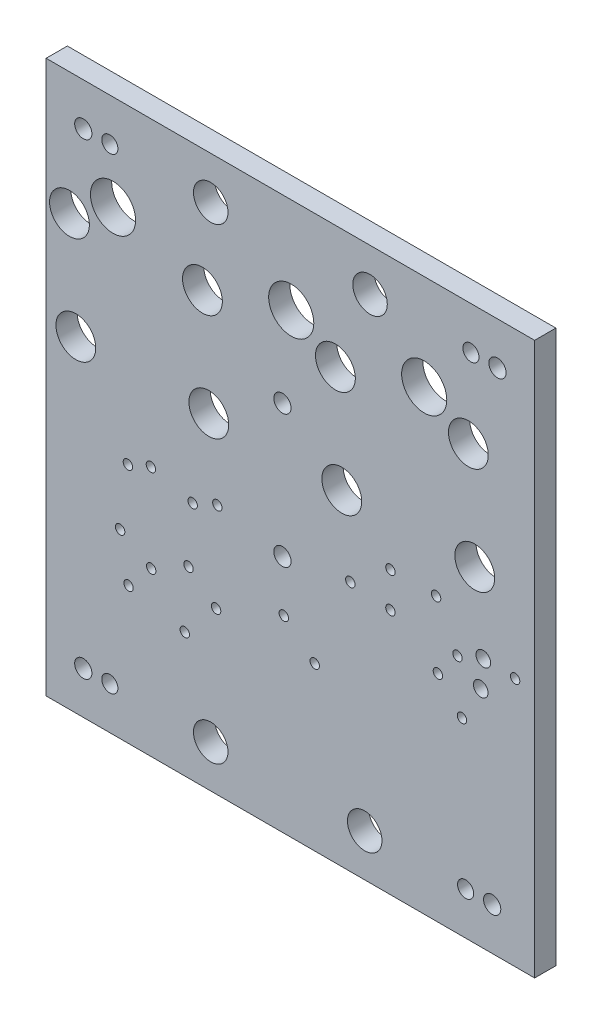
ISO-10303-21;
HEADER;
FILE_DESCRIPTION(('STEP AP214'),'2;1');
FILE_NAME('part.step','',(''),(''),'','','');
FILE_SCHEMA(('AUTOMOTIVE_DESIGN { 1 0 10303 214 1 1 1 1 }'));
ENDSEC;
DATA;
#1=APPLICATION_CONTEXT('core data for automotive mechanical design processes');
#2=APPLICATION_PROTOCOL_DEFINITION('international standard','automotive_design',2000,#1);
#3=PRODUCT_CONTEXT('',#1,'mechanical');
#4=PRODUCT('Part','Part','',(#3));
#5=PRODUCT_RELATED_PRODUCT_CATEGORY('part','',(#4));
#6=PRODUCT_DEFINITION_FORMATION('','',#4);
#7=PRODUCT_DEFINITION_CONTEXT('part definition',#1,'design');
#8=PRODUCT_DEFINITION('design','',#6,#7);
#9=PRODUCT_DEFINITION_SHAPE('','',#8);
#10=(LENGTH_UNIT() NAMED_UNIT(*) SI_UNIT(.MILLI.,.METRE.));
#11=(NAMED_UNIT(*) PLANE_ANGLE_UNIT() SI_UNIT($,.RADIAN.));
#12=(NAMED_UNIT(*) SI_UNIT($,.STERADIAN.) SOLID_ANGLE_UNIT());
#13=UNCERTAINTY_MEASURE_WITH_UNIT(LENGTH_MEASURE(1.E-05),#10,'distance_accuracy_value','');
#14=(GEOMETRIC_REPRESENTATION_CONTEXT(3) GLOBAL_UNCERTAINTY_ASSIGNED_CONTEXT((#13)) GLOBAL_UNIT_ASSIGNED_CONTEXT((#10,
#11,#12)) REPRESENTATION_CONTEXT('',''));
#15=CARTESIAN_POINT('',(0.,0.,0.));
#16=DIRECTION('',(0.,0.,1.));
#17=DIRECTION('',(1.,0.,0.));
#18=AXIS2_PLACEMENT_3D('',#15,#16,#17);
#19=CARTESIAN_POINT('',(-452.12,-180.975,12.7));
#20=DIRECTION('',(-1.,0.,0.));
#21=DIRECTION('',(0.,0.,1.));
#22=AXIS2_PLACEMENT_3D('',#19,#20,#21);
#23=PLANE('',#22);
#24=DIRECTION('',(0.,1.,0.));
#25=VECTOR('',#24,1.);
#26=CARTESIAN_POINT('',(-452.12,-180.975,0.));
#27=LINE('',#26,#25);
#28=CARTESIAN_POINT('',(-452.12,-180.975,0.));
#29=VERTEX_POINT('',#28);
#30=CARTESIAN_POINT('',(-452.12,149.225,0.));
#31=VERTEX_POINT('',#30);
#32=EDGE_CURVE('E106',#29,#31,#27,.T.);
#33=ORIENTED_EDGE('',*,*,#32,.T.);
#34=DIRECTION('',(0.,0.,-1.));
#35=VECTOR('',#34,1.);
#36=CARTESIAN_POINT('',(-452.12,149.225,12.7));
#37=LINE('',#36,#35);
#38=CARTESIAN_POINT('',(-452.12,149.225,12.7));
#39=VERTEX_POINT('',#38);
#40=EDGE_CURVE('E11',#39,#31,#37,.T.);
#41=ORIENTED_EDGE('',*,*,#40,.F.);
#42=DIRECTION('',(0.,1.,0.));
#43=VECTOR('',#42,1.);
#44=CARTESIAN_POINT('',(-452.12,-180.975,12.7));
#45=LINE('',#44,#43);
#46=CARTESIAN_POINT('',(-452.12,-180.975,12.7));
#47=VERTEX_POINT('',#46);
#48=EDGE_CURVE('E94',#47,#39,#45,.T.);
#49=ORIENTED_EDGE('',*,*,#48,.F.);
#50=DIRECTION('',(0.,0.,-1.));
#51=VECTOR('',#50,1.);
#52=CARTESIAN_POINT('',(-452.12,-180.975,12.7));
#53=LINE('',#52,#51);
#54=EDGE_CURVE('E102',#47,#29,#53,.T.);
#55=ORIENTED_EDGE('',*,*,#54,.T.);
#56=EDGE_LOOP('',(#33,#41,#49,#55));
#57=FACE_BOUND('',#56,.T.);
#58=ADVANCED_FACE('F43',(#57),#23,.F.);
#59=CARTESIAN_POINT('',(-452.12,149.225,12.7));
#60=DIRECTION('',(0.,-1.,0.));
#61=DIRECTION('',(0.,0.,-1.));
#62=AXIS2_PLACEMENT_3D('',#59,#60,#61);
#63=PLANE('',#62);
#64=DIRECTION('',(-1.,0.,0.));
#65=VECTOR('',#64,1.);
#66=CARTESIAN_POINT('',(-452.12,149.225,0.));
#67=LINE('',#66,#65);
#68=CARTESIAN_POINT('',(-744.22,149.225,0.));
#69=VERTEX_POINT('',#68);
#70=EDGE_CURVE('E98',#31,#69,#67,.T.);
#71=ORIENTED_EDGE('',*,*,#70,.T.);
#72=DIRECTION('',(0.,0.,-1.));
#73=VECTOR('',#72,1.);
#74=CARTESIAN_POINT('',(-744.22,149.225,12.7));
#75=LINE('',#74,#73);
#76=CARTESIAN_POINT('',(-744.22,149.225,12.7));
#77=VERTEX_POINT('',#76);
#78=EDGE_CURVE('E51',#77,#69,#75,.T.);
#79=ORIENTED_EDGE('',*,*,#78,.F.);
#80=DIRECTION('',(-1.,0.,0.));
#81=VECTOR('',#80,1.);
#82=CARTESIAN_POINT('',(-452.12,149.225,12.7));
#83=LINE('',#82,#81);
#84=EDGE_CURVE('E89',#39,#77,#83,.T.);
#85=ORIENTED_EDGE('',*,*,#84,.F.);
#86=ORIENTED_EDGE('',*,*,#40,.T.);
#87=EDGE_LOOP('',(#71,#79,#85,#86));
#88=FACE_BOUND('',#87,.T.);
#89=ADVANCED_FACE('F97',(#88),#63,.F.);
#90=CARTESIAN_POINT('',(-744.22,149.225,12.7));
#91=DIRECTION('',(1.,0.,0.));
#92=DIRECTION('',(0.,0.,-1.));
#93=AXIS2_PLACEMENT_3D('',#90,#91,#92);
#94=PLANE('',#93);
#95=DIRECTION('',(0.,-1.,0.));
#96=VECTOR('',#95,1.);
#97=CARTESIAN_POINT('',(-744.22,149.225,0.));
#98=LINE('',#97,#96);
#99=CARTESIAN_POINT('',(-744.22,-180.975,0.));
#100=VERTEX_POINT('',#99);
#101=EDGE_CURVE('E76',#69,#100,#98,.T.);
#102=ORIENTED_EDGE('',*,*,#101,.T.);
#103=DIRECTION('',(0.,0.,-1.));
#104=VECTOR('',#103,1.);
#105=CARTESIAN_POINT('',(-744.22,-180.975,12.7));
#106=LINE('',#105,#104);
#107=CARTESIAN_POINT('',(-744.22,-180.975,12.7));
#108=VERTEX_POINT('',#107);
#109=EDGE_CURVE('E99',#108,#100,#106,.T.);
#110=ORIENTED_EDGE('',*,*,#109,.F.);
#111=DIRECTION('',(0.,-1.,0.));
#112=VECTOR('',#111,1.);
#113=CARTESIAN_POINT('',(-744.22,149.225,12.7));
#114=LINE('',#113,#112);
#115=EDGE_CURVE('E92',#77,#108,#114,.T.);
#116=ORIENTED_EDGE('',*,*,#115,.F.);
#117=ORIENTED_EDGE('',*,*,#78,.T.);
#118=EDGE_LOOP('',(#102,#110,#116,#117));
#119=FACE_BOUND('',#118,.T.);
#120=ADVANCED_FACE('F100',(#119),#94,.F.);
#121=CARTESIAN_POINT('',(-744.22,-180.975,12.7));
#122=DIRECTION('',(0.,1.,0.));
#123=DIRECTION('',(-1.,0.,0.));
#124=AXIS2_PLACEMENT_3D('',#121,#122,#123);
#125=PLANE('',#124);
#126=DIRECTION('',(1.,0.,0.));
#127=VECTOR('',#126,1.);
#128=CARTESIAN_POINT('',(-744.22,-180.975,0.));
#129=LINE('',#128,#127);
#130=EDGE_CURVE('E82',#100,#29,#129,.T.);
#131=ORIENTED_EDGE('',*,*,#130,.T.);
#132=ORIENTED_EDGE('',*,*,#54,.F.);
#133=DIRECTION('',(1.,0.,0.));
#134=VECTOR('',#133,1.);
#135=CARTESIAN_POINT('',(-744.22,-180.975,12.7));
#136=LINE('',#135,#134);
#137=EDGE_CURVE('E59',#108,#47,#136,.T.);
#138=ORIENTED_EDGE('',*,*,#137,.F.);
#139=ORIENTED_EDGE('',*,*,#109,.T.);
#140=EDGE_LOOP('',(#131,#132,#138,#139));
#141=FACE_BOUND('',#140,.T.);
#142=ADVANCED_FACE('F114',(#141),#125,.F.);
#143=CARTESIAN_POINT('',(0.,0.,12.7));
#144=DIRECTION('',(0.,0.,1.));
#145=DIRECTION('',(1.,0.,0.));
#146=AXIS2_PLACEMENT_3D('',#143,#144,#145);
#147=PLANE('',#146);
#148=CARTESIAN_POINT('',(-484.346782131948,-47.2994414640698,12.7));
#149=DIRECTION('',(0.,0.,1.));
#150=DIRECTION('',(1.,0.,0.));
#151=AXIS2_PLACEMENT_3D('',#148,#149,#150);
#152=CIRCLE('',#151,4.36562499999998);
#153=CARTESIAN_POINT('',(-479.981157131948,-47.2994414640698,12.7));
#154=VERTEX_POINT('',#153);
#155=EDGE_CURVE('E395',#154,#154,#152,.T.);
#156=ORIENTED_EDGE('',*,*,#155,.F.);
#157=EDGE_LOOP('',(#156));
#158=FACE_BOUND('',#157,.T.);
#159=CARTESIAN_POINT('',(-482.821795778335,-31.0085922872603,12.7));
#160=DIRECTION('',(0.,0.,1.));
#161=DIRECTION('',(1.,0.,0.));
#162=AXIS2_PLACEMENT_3D('',#159,#160,#161);
#163=CIRCLE('',#162,4.36562499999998);
#164=CARTESIAN_POINT('',(-478.456170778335,-31.0085922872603,12.7));
#165=VERTEX_POINT('',#164);
#166=EDGE_CURVE('E389',#165,#165,#163,.T.);
#167=ORIENTED_EDGE('',*,*,#166,.F.);
#168=EDGE_LOOP('',(#167));
#169=FACE_BOUND('',#168,.T.);
#170=CARTESIAN_POINT('',(-493.395,-155.575,12.7));
#171=DIRECTION('',(0.,0.,-1.));
#172=DIRECTION('',(-1.,0.,0.));
#173=AXIS2_PLACEMENT_3D('',#170,#171,#172);
#174=CIRCLE('',#173,4.826);
#175=CARTESIAN_POINT('',(-498.221,-155.575,12.7));
#176=VERTEX_POINT('',#175);
#177=EDGE_CURVE('E386',#176,#176,#174,.T.);
#178=ORIENTED_EDGE('',*,*,#177,.T.);
#179=EDGE_LOOP('',(#178));
#180=FACE_BOUND('',#179,.T.);
#181=CARTESIAN_POINT('',(-706.12,-155.575,12.7));
#182=DIRECTION('',(0.,0.,-1.));
#183=DIRECTION('',(-1.,0.,0.));
#184=AXIS2_PLACEMENT_3D('',#181,#182,#183);
#185=CIRCLE('',#184,4.826);
#186=CARTESIAN_POINT('',(-710.946,-155.575,12.7));
#187=VERTEX_POINT('',#186);
#188=EDGE_CURVE('E380',#187,#187,#185,.T.);
#189=ORIENTED_EDGE('',*,*,#188,.T.);
#190=EDGE_LOOP('',(#189));
#191=FACE_BOUND('',#190,.T.);
#192=CARTESIAN_POINT('',(-706.12,123.825,12.7));
#193=DIRECTION('',(0.,0.,-1.));
#194=DIRECTION('',(-1.,0.,0.));
#195=AXIS2_PLACEMENT_3D('',#192,#193,#194);
#196=CIRCLE('',#195,4.826);
#197=CARTESIAN_POINT('',(-710.946,123.825,12.7));
#198=VERTEX_POINT('',#197);
#199=EDGE_CURVE('E374',#198,#198,#196,.T.);
#200=ORIENTED_EDGE('',*,*,#199,.T.);
#201=EDGE_LOOP('',(#200));
#202=FACE_BOUND('',#201,.T.);
#203=CARTESIAN_POINT('',(-490.22,123.825,12.7));
#204=DIRECTION('',(0.,0.,-1.));
#205=DIRECTION('',(-1.,0.,0.));
#206=AXIS2_PLACEMENT_3D('',#203,#204,#205);
#207=CIRCLE('',#206,4.826);
#208=CARTESIAN_POINT('',(-495.046,123.825,12.7));
#209=VERTEX_POINT('',#208);
#210=EDGE_CURVE('E368',#209,#209,#207,.T.);
#211=ORIENTED_EDGE('',*,*,#210,.T.);
#212=EDGE_LOOP('',(#211));
#213=FACE_BOUND('',#212,.T.);
#214=CARTESIAN_POINT('',(-645.795,123.825,12.7));
#215=DIRECTION('',(0.,0.,1.));
#216=DIRECTION('',(1.,0.,0.));
#217=AXIS2_PLACEMENT_3D('',#214,#215,#216);
#218=CIRCLE('',#217,10.31875);
#219=CARTESIAN_POINT('',(-635.47625,123.825,12.7));
#220=VERTEX_POINT('',#219);
#221=EDGE_CURVE('E359',#220,#220,#218,.T.);
#222=ORIENTED_EDGE('',*,*,#221,.F.);
#223=EDGE_LOOP('',(#222));
#224=FACE_BOUND('',#223,.T.);
#225=CARTESIAN_POINT('',(-550.545,123.825,12.7));
#226=DIRECTION('',(0.,0.,1.));
#227=DIRECTION('',(1.,0.,0.));
#228=AXIS2_PLACEMENT_3D('',#225,#226,#227);
#229=CIRCLE('',#228,10.31875);
#230=CARTESIAN_POINT('',(-540.22625,123.825,12.7));
#231=VERTEX_POINT('',#230);
#232=EDGE_CURVE('E353',#231,#231,#229,.T.);
#233=ORIENTED_EDGE('',*,*,#232,.F.);
#234=EDGE_LOOP('',(#233));
#235=FACE_BOUND('',#234,.T.);
#236=CARTESIAN_POINT('',(-553.72,-155.575,12.7));
#237=DIRECTION('',(0.,0.,1.));
#238=DIRECTION('',(1.,0.,0.));
#239=AXIS2_PLACEMENT_3D('',#236,#237,#238);
#240=CIRCLE('',#239,10.31875);
#241=CARTESIAN_POINT('',(-543.40125,-155.575,12.7));
#242=VERTEX_POINT('',#241);
#243=EDGE_CURVE('E347',#242,#242,#240,.T.);
#244=ORIENTED_EDGE('',*,*,#243,.F.);
#245=EDGE_LOOP('',(#244));
#246=FACE_BOUND('',#245,.T.);
#247=CARTESIAN_POINT('',(-645.795,-155.575,12.7));
#248=DIRECTION('',(0.,0.,1.));
#249=DIRECTION('',(1.,0.,0.));
#250=AXIS2_PLACEMENT_3D('',#247,#248,#249);
#251=CIRCLE('',#250,10.31875);
#252=CARTESIAN_POINT('',(-635.47625,-155.575,12.7));
#253=VERTEX_POINT('',#252);
#254=EDGE_CURVE('E341',#253,#253,#251,.T.);
#255=ORIENTED_EDGE('',*,*,#254,.F.);
#256=EDGE_LOOP('',(#255));
#257=FACE_BOUND('',#256,.T.);
#258=CARTESIAN_POINT('',(-477.52,-155.575,12.7));
#259=DIRECTION('',(0.,0.,1.));
#260=DIRECTION('',(1.,0.,0.));
#261=AXIS2_PLACEMENT_3D('',#258,#259,#260);
#262=CIRCLE('',#261,5.1562);
#263=CARTESIAN_POINT('',(-472.3638,-155.575,12.7));
#264=VERTEX_POINT('',#263);
#265=EDGE_CURVE('E335',#264,#264,#262,.T.);
#266=ORIENTED_EDGE('',*,*,#265,.F.);
#267=EDGE_LOOP('',(#266));
#268=FACE_BOUND('',#267,.T.);
#269=CARTESIAN_POINT('',(-474.345,123.825,12.7));
#270=DIRECTION('',(0.,0.,1.));
#271=DIRECTION('',(1.,0.,0.));
#272=AXIS2_PLACEMENT_3D('',#269,#270,#271);
#273=CIRCLE('',#272,5.1562);
#274=CARTESIAN_POINT('',(-469.1888,123.825,12.7));
#275=VERTEX_POINT('',#274);
#276=EDGE_CURVE('E329',#275,#275,#273,.T.);
#277=ORIENTED_EDGE('',*,*,#276,.F.);
#278=EDGE_LOOP('',(#277));
#279=FACE_BOUND('',#278,.T.);
#280=CARTESIAN_POINT('',(-721.995,123.825,12.7));
#281=DIRECTION('',(0.,0.,1.));
#282=DIRECTION('',(1.,0.,0.));
#283=AXIS2_PLACEMENT_3D('',#280,#281,#282);
#284=CIRCLE('',#283,5.15620000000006);
#285=CARTESIAN_POINT('',(-716.8388,123.825,12.7));
#286=VERTEX_POINT('',#285);
#287=EDGE_CURVE('E323',#286,#286,#284,.T.);
#288=ORIENTED_EDGE('',*,*,#287,.F.);
#289=EDGE_LOOP('',(#288));
#290=FACE_BOUND('',#289,.T.);
#291=CARTESIAN_POINT('',(-721.995,-155.575,12.7));
#292=DIRECTION('',(0.,0.,1.));
#293=DIRECTION('',(1.,0.,0.));
#294=AXIS2_PLACEMENT_3D('',#291,#292,#293);
#295=CIRCLE('',#294,5.15620000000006);
#296=CARTESIAN_POINT('',(-716.8388,-155.575,12.7));
#297=VERTEX_POINT('',#296);
#298=EDGE_CURVE('E317',#297,#297,#295,.T.);
#299=ORIENTED_EDGE('',*,*,#298,.F.);
#300=EDGE_LOOP('',(#299));
#301=FACE_BOUND('',#300,.T.);
#302=CARTESIAN_POINT('',(-602.9325,41.275,12.7));
#303=DIRECTION('',(0.,0.,1.));
#304=DIRECTION('',(1.,0.,0.));
#305=AXIS2_PLACEMENT_3D('',#302,#303,#304);
#306=CIRCLE('',#305,5.15620000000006);
#307=CARTESIAN_POINT('',(-597.7763,41.275,12.7));
#308=VERTEX_POINT('',#307);
#309=EDGE_CURVE('E311',#308,#308,#306,.T.);
#310=ORIENTED_EDGE('',*,*,#309,.F.);
#311=EDGE_LOOP('',(#310));
#312=FACE_BOUND('',#311,.T.);
#313=CARTESIAN_POINT('',(-602.9325,-38.1,12.7));
#314=DIRECTION('',(0.,0.,1.));
#315=DIRECTION('',(1.,0.,0.));
#316=AXIS2_PLACEMENT_3D('',#313,#314,#315);
#317=CIRCLE('',#316,5.15620000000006);
#318=CARTESIAN_POINT('',(-597.7763,-38.1,12.7));
#319=VERTEX_POINT('',#318);
#320=EDGE_CURVE('E305',#319,#319,#317,.T.);
#321=ORIENTED_EDGE('',*,*,#320,.F.);
#322=EDGE_LOOP('',(#321));
#323=FACE_BOUND('',#322,.T.);
#324=CARTESIAN_POINT('',(-495.568692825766,-68.0283667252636,12.7));
#325=DIRECTION('',(0.,0.,1.));
#326=DIRECTION('',(1.,0.,0.));
#327=AXIS2_PLACEMENT_3D('',#324,#325,#326);
#328=CIRCLE('',#327,2.8067);
#329=CARTESIAN_POINT('',(-492.761992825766,-68.0283667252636,12.7));
#330=VERTEX_POINT('',#329);
#331=EDGE_CURVE('E299',#330,#330,#328,.T.);
#332=ORIENTED_EDGE('',*,*,#331,.F.);
#333=EDGE_LOOP('',(#332));
#334=FACE_BOUND('',#333,.T.);
#335=CARTESIAN_POINT('',(-463.795238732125,-31.75,12.7));
#336=DIRECTION('',(0.,0.,1.));
#337=DIRECTION('',(1.,0.,0.));
#338=AXIS2_PLACEMENT_3D('',#335,#336,#337);
#339=CIRCLE('',#338,2.8067);
#340=CARTESIAN_POINT('',(-460.988538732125,-31.75,12.7));
#341=VERTEX_POINT('',#340);
#342=EDGE_CURVE('E293',#341,#341,#339,.T.);
#343=ORIENTED_EDGE('',*,*,#342,.F.);
#344=EDGE_LOOP('',(#343));
#345=FACE_BOUND('',#344,.T.);
#346=CARTESIAN_POINT('',(-695.325000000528,-36.6948728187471,12.7));
#347=DIRECTION('',(0.,0.,1.));
#348=DIRECTION('',(1.,0.,0.));
#349=AXIS2_PLACEMENT_3D('',#346,#347,#348);
#350=CIRCLE('',#349,2.80670000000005);
#351=CARTESIAN_POINT('',(-692.518300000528,-36.6948728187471,12.7));
#352=VERTEX_POINT('',#351);
#353=EDGE_CURVE('E287',#352,#352,#350,.T.);
#354=ORIENTED_EDGE('',*,*,#353,.F.);
#355=EDGE_LOOP('',(#354));
#356=FACE_BOUND('',#355,.T.);
#357=CARTESIAN_POINT('',(-681.576795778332,-31.0085922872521,12.7));
#358=DIRECTION('',(0.,0.,1.));
#359=DIRECTION('',(1.,0.,0.));
#360=AXIS2_PLACEMENT_3D('',#357,#358,#359);
#361=CIRCLE('',#360,2.80670000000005);
#362=CARTESIAN_POINT('',(-678.770095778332,-31.0085922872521,12.7));
#363=VERTEX_POINT('',#362);
#364=EDGE_CURVE('E281',#363,#363,#361,.T.);
#365=ORIENTED_EDGE('',*,*,#364,.F.);
#366=EDGE_LOOP('',(#365));
#367=FACE_BOUND('',#366,.T.);
#368=CARTESIAN_POINT('',(-699.969677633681,-72.610364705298,12.7));
#369=DIRECTION('',(0.,0.,1.));
#370=DIRECTION('',(1.,0.,0.));
#371=AXIS2_PLACEMENT_3D('',#368,#369,#370);
#372=CIRCLE('',#371,2.80670000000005);
#373=CARTESIAN_POINT('',(-697.162977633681,-72.610364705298,12.7));
#374=VERTEX_POINT('',#373);
#375=EDGE_CURVE('E275',#374,#374,#372,.T.);
#376=ORIENTED_EDGE('',*,*,#375,.F.);
#377=EDGE_LOOP('',(#376));
#378=FACE_BOUND('',#377,.T.);
#379=CARTESIAN_POINT('',(-681.397191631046,-83.5701362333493,12.7));
#380=DIRECTION('',(0.,0.,1.));
#381=DIRECTION('',(1.,0.,0.));
#382=AXIS2_PLACEMENT_3D('',#379,#380,#381);
#383=CIRCLE('',#382,2.80670000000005);
#384=CARTESIAN_POINT('',(-678.590491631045,-83.5701362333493,12.7));
#385=VERTEX_POINT('',#384);
#386=EDGE_CURVE('E269',#385,#385,#383,.T.);
#387=ORIENTED_EDGE('',*,*,#386,.F.);
#388=EDGE_LOOP('',(#387));
#389=FACE_BOUND('',#388,.T.);
#390=CARTESIAN_POINT('',(-694.928996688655,-99.1520699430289,12.7));
#391=DIRECTION('',(0.,0.,1.));
#392=DIRECTION('',(1.,0.,0.));
#393=AXIS2_PLACEMENT_3D('',#390,#391,#392);
#394=CIRCLE('',#393,2.80670000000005);
#395=CARTESIAN_POINT('',(-692.122296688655,-99.1520699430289,12.7));
#396=VERTEX_POINT('',#395);
#397=EDGE_CURVE('E263',#396,#396,#394,.T.);
#398=ORIENTED_EDGE('',*,*,#397,.F.);
#399=EDGE_LOOP('',(#398));
#400=FACE_BOUND('',#399,.T.);
#401=CARTESIAN_POINT('',(-659.071352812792,-71.4200672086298,12.7));
#402=DIRECTION('',(0.,0.,1.));
#403=DIRECTION('',(1.,0.,0.));
#404=AXIS2_PLACEMENT_3D('',#401,#402,#403);
#405=CIRCLE('',#404,2.80670000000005);
#406=CARTESIAN_POINT('',(-656.264652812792,-71.4200672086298,12.7));
#407=VERTEX_POINT('',#406);
#408=EDGE_CURVE('E257',#407,#407,#405,.T.);
#409=ORIENTED_EDGE('',*,*,#408,.F.);
#410=EDGE_LOOP('',(#409));
#411=FACE_BOUND('',#410,.T.);
#412=CARTESIAN_POINT('',(-656.590000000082,-37.329872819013,12.7));
#413=DIRECTION('',(0.,0.,1.));
#414=DIRECTION('',(1.,0.,0.));
#415=AXIS2_PLACEMENT_3D('',#412,#413,#414);
#416=CIRCLE('',#415,2.80670000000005);
#417=CARTESIAN_POINT('',(-653.783300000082,-37.329872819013,12.7));
#418=VERTEX_POINT('',#417);
#419=EDGE_CURVE('E251',#418,#418,#416,.T.);
#420=ORIENTED_EDGE('',*,*,#419,.F.);
#421=EDGE_LOOP('',(#420));
#422=FACE_BOUND('',#421,.T.);
#423=CARTESIAN_POINT('',(-641.825795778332,-31.0085922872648,12.7));
#424=DIRECTION('',(0.,0.,1.));
#425=DIRECTION('',(1.,0.,0.));
#426=AXIS2_PLACEMENT_3D('',#423,#424,#425);
#427=CIRCLE('',#426,2.80670000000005);
#428=CARTESIAN_POINT('',(-639.019095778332,-31.0085922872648,12.7));
#429=VERTEX_POINT('',#428);
#430=EDGE_CURVE('E245',#429,#429,#427,.T.);
#431=ORIENTED_EDGE('',*,*,#430,.F.);
#432=EDGE_LOOP('',(#431));
#433=FACE_BOUND('',#432,.T.);
#434=CARTESIAN_POINT('',(-661.310720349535,-106.441625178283,12.7));
#435=DIRECTION('',(0.,0.,1.));
#436=DIRECTION('',(1.,0.,0.));
#437=AXIS2_PLACEMENT_3D('',#434,#435,#436);
#438=CIRCLE('',#437,2.80670000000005);
#439=CARTESIAN_POINT('',(-658.504020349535,-106.441625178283,12.7));
#440=VERTEX_POINT('',#439);
#441=EDGE_CURVE('E239',#440,#440,#438,.T.);
#442=ORIENTED_EDGE('',*,*,#441,.F.);
#443=EDGE_LOOP('',(#442));
#444=FACE_BOUND('',#443,.T.);
#445=CARTESIAN_POINT('',(-642.574374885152,-84.8666400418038,12.7));
#446=DIRECTION('',(0.,0.,1.));
#447=DIRECTION('',(1.,0.,0.));
#448=AXIS2_PLACEMENT_3D('',#445,#446,#447);
#449=CIRCLE('',#448,2.80670000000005);
#450=CARTESIAN_POINT('',(-639.767674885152,-84.8666400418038,12.7));
#451=VERTEX_POINT('',#450);
#452=EDGE_CURVE('E233',#451,#451,#449,.T.);
#453=ORIENTED_EDGE('',*,*,#452,.F.);
#454=EDGE_LOOP('',(#453));
#455=FACE_BOUND('',#454,.T.);
#456=CARTESIAN_POINT('',(-602.1057603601,-68.3480898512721,12.7));
#457=DIRECTION('',(0.,0.,1.));
#458=DIRECTION('',(1.,0.,0.));
#459=AXIS2_PLACEMENT_3D('',#456,#457,#458);
#460=CIRCLE('',#459,2.80670000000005);
#461=CARTESIAN_POINT('',(-599.2990603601,-68.3480898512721,12.7));
#462=VERTEX_POINT('',#461);
#463=EDGE_CURVE('E227',#462,#462,#460,.T.);
#464=ORIENTED_EDGE('',*,*,#463,.F.);
#465=EDGE_LOOP('',(#464));
#466=FACE_BOUND('',#465,.T.);
#467=CARTESIAN_POINT('',(-583.621107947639,-83.8585548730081,12.7));
#468=DIRECTION('',(0.,0.,1.));
#469=DIRECTION('',(1.,0.,0.));
#470=AXIS2_PLACEMENT_3D('',#467,#468,#469);
#471=CIRCLE('',#470,2.80670000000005);
#472=CARTESIAN_POINT('',(-580.814407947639,-83.8585548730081,12.7));
#473=VERTEX_POINT('',#472);
#474=EDGE_CURVE('E221',#473,#473,#471,.T.);
#475=ORIENTED_EDGE('',*,*,#474,.F.);
#476=EDGE_LOOP('',(#475));
#477=FACE_BOUND('',#476,.T.);
#478=CARTESIAN_POINT('',(-562.323795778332,-31.0085922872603,12.7));
#479=DIRECTION('',(0.,0.,1.));
#480=DIRECTION('',(1.,0.,0.));
#481=AXIS2_PLACEMENT_3D('',#478,#479,#480);
#482=CIRCLE('',#481,2.80670000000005);
#483=CARTESIAN_POINT('',(-559.517095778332,-31.0085922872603,12.7));
#484=VERTEX_POINT('',#483);
#485=EDGE_CURVE('E215',#484,#484,#482,.T.);
#486=ORIENTED_EDGE('',*,*,#485,.F.);
#487=EDGE_LOOP('',(#486));
#488=FACE_BOUND('',#487,.T.);
#489=CARTESIAN_POINT('',(-538.346152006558,-12.6478402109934,12.7));
#490=DIRECTION('',(0.,0.,1.));
#491=DIRECTION('',(1.,0.,0.));
#492=AXIS2_PLACEMENT_3D('',#489,#490,#491);
#493=CIRCLE('',#492,2.80670000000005);
#494=CARTESIAN_POINT('',(-535.539452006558,-12.6478402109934,12.7));
#495=VERTEX_POINT('',#494);
#496=EDGE_CURVE('E209',#495,#495,#493,.T.);
#497=ORIENTED_EDGE('',*,*,#496,.F.);
#498=EDGE_LOOP('',(#497));
#499=FACE_BOUND('',#498,.T.);
#500=CARTESIAN_POINT('',(-538.346152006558,-33.6028402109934,12.7));
#501=DIRECTION('',(0.,0.,1.));
#502=DIRECTION('',(1.,0.,0.));
#503=AXIS2_PLACEMENT_3D('',#500,#501,#502);
#504=CIRCLE('',#503,2.80670000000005);
#505=CARTESIAN_POINT('',(-535.539452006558,-33.6028402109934,12.7));
#506=VERTEX_POINT('',#505);
#507=EDGE_CURVE('E203',#506,#506,#504,.T.);
#508=ORIENTED_EDGE('',*,*,#507,.F.);
#509=EDGE_LOOP('',(#508));
#510=FACE_BOUND('',#509,.T.);
#511=CARTESIAN_POINT('',(-511.041152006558,-12.6478402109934,12.7));
#512=DIRECTION('',(0.,0.,1.));
#513=DIRECTION('',(1.,0.,0.));
#514=AXIS2_PLACEMENT_3D('',#511,#512,#513);
#515=CIRCLE('',#514,2.80670000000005);
#516=CARTESIAN_POINT('',(-508.234452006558,-12.6478402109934,12.7));
#517=VERTEX_POINT('',#516);
#518=EDGE_CURVE('E197',#517,#517,#515,.T.);
#519=ORIENTED_EDGE('',*,*,#518,.F.);
#520=EDGE_LOOP('',(#519));
#521=FACE_BOUND('',#520,.T.);
#522=CARTESIAN_POINT('',(-498.241770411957,-37.1963912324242,12.7));
#523=DIRECTION('',(0.,0.,1.));
#524=DIRECTION('',(1.,0.,0.));
#525=AXIS2_PLACEMENT_3D('',#522,#523,#524);
#526=CIRCLE('',#525,2.8067);
#527=CARTESIAN_POINT('',(-495.435070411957,-37.1963912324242,12.7));
#528=VERTEX_POINT('',#527);
#529=EDGE_CURVE('E191',#528,#528,#526,.T.);
#530=ORIENTED_EDGE('',*,*,#529,.F.);
#531=EDGE_LOOP('',(#530));
#532=FACE_BOUND('',#531,.T.);
#533=CARTESIAN_POINT('',(-509.970121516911,-52.2079960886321,12.7));
#534=DIRECTION('',(0.,0.,1.));
#535=DIRECTION('',(1.,0.,0.));
#536=AXIS2_PLACEMENT_3D('',#533,#534,#535);
#537=CIRCLE('',#536,2.80670000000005);
#538=CARTESIAN_POINT('',(-507.163421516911,-52.2079960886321,12.7));
#539=VERTEX_POINT('',#538);
#540=EDGE_CURVE('E185',#539,#539,#537,.T.);
#541=ORIENTED_EDGE('',*,*,#540,.F.);
#542=EDGE_LOOP('',(#541));
#543=FACE_BOUND('',#542,.T.);
#544=CARTESIAN_POINT('',(-491.744,75.8952,12.7));
#545=DIRECTION('',(0.,0.,-1.));
#546=DIRECTION('',(-1.,0.,0.));
#547=AXIS2_PLACEMENT_3D('',#544,#545,#546);
#548=CIRCLE('',#547,11.90625);
#549=CARTESIAN_POINT('',(-503.65025,75.8952,12.7));
#550=VERTEX_POINT('',#549);
#551=EDGE_CURVE('E182',#550,#550,#548,.T.);
#552=ORIENTED_EDGE('',*,*,#551,.T.);
#553=EDGE_LOOP('',(#552));
#554=FACE_BOUND('',#553,.T.);
#555=CARTESIAN_POINT('',(-567.436,13.97,12.7));
#556=DIRECTION('',(0.,0.,-1.));
#557=DIRECTION('',(-1.,0.,0.));
#558=AXIS2_PLACEMENT_3D('',#555,#556,#557);
#559=CIRCLE('',#558,11.90625);
#560=CARTESIAN_POINT('',(-579.34225,13.97,12.7));
#561=VERTEX_POINT('',#560);
#562=EDGE_CURVE('E176',#561,#561,#559,.T.);
#563=ORIENTED_EDGE('',*,*,#562,.T.);
#564=EDGE_LOOP('',(#563));
#565=FACE_BOUND('',#564,.T.);
#566=CARTESIAN_POINT('',(-571.246,75.8952,12.7));
#567=DIRECTION('',(0.,0.,-1.));
#568=DIRECTION('',(-1.,0.,0.));
#569=AXIS2_PLACEMENT_3D('',#566,#567,#568);
#570=CIRCLE('',#569,11.90625);
#571=CARTESIAN_POINT('',(-583.15225,75.8952,12.7));
#572=VERTEX_POINT('',#571);
#573=EDGE_CURVE('E170',#572,#572,#570,.T.);
#574=ORIENTED_EDGE('',*,*,#573,.T.);
#575=EDGE_LOOP('',(#574));
#576=FACE_BOUND('',#575,.T.);
#577=CARTESIAN_POINT('',(-650.748,75.8952,12.7));
#578=DIRECTION('',(0.,0.,-1.));
#579=DIRECTION('',(-1.,0.,0.));
#580=AXIS2_PLACEMENT_3D('',#577,#578,#579);
#581=CIRCLE('',#580,11.90625);
#582=CARTESIAN_POINT('',(-662.65425,75.8952,12.7));
#583=VERTEX_POINT('',#582);
#584=EDGE_CURVE('E164',#583,#583,#581,.T.);
#585=ORIENTED_EDGE('',*,*,#584,.T.);
#586=EDGE_LOOP('',(#585));
#587=FACE_BOUND('',#586,.T.);
#588=CARTESIAN_POINT('',(-646.938,13.97,12.7));
#589=DIRECTION('',(0.,0.,-1.));
#590=DIRECTION('',(-1.,0.,0.));
#591=AXIS2_PLACEMENT_3D('',#588,#589,#590);
#592=CIRCLE('',#591,11.90625);
#593=CARTESIAN_POINT('',(-658.84425,13.97,12.7));
#594=VERTEX_POINT('',#593);
#595=EDGE_CURVE('E158',#594,#594,#592,.T.);
#596=ORIENTED_EDGE('',*,*,#595,.T.);
#597=EDGE_LOOP('',(#596));
#598=FACE_BOUND('',#597,.T.);
#599=CARTESIAN_POINT('',(-730.25,75.8952,12.7));
#600=DIRECTION('',(0.,0.,-1.));
#601=DIRECTION('',(-1.,0.,0.));
#602=AXIS2_PLACEMENT_3D('',#599,#600,#601);
#603=CIRCLE('',#602,11.90625);
#604=CARTESIAN_POINT('',(-742.15625,75.8952,12.7));
#605=VERTEX_POINT('',#604);
#606=EDGE_CURVE('E152',#605,#605,#603,.T.);
#607=ORIENTED_EDGE('',*,*,#606,.T.);
#608=EDGE_LOOP('',(#607));
#609=FACE_BOUND('',#608,.T.);
#610=CARTESIAN_POINT('',(-726.44,13.97,12.7));
#611=DIRECTION('',(0.,0.,-1.));
#612=DIRECTION('',(-1.,0.,0.));
#613=AXIS2_PLACEMENT_3D('',#610,#611,#612);
#614=CIRCLE('',#613,11.90625);
#615=CARTESIAN_POINT('',(-738.34625,13.97,12.7));
#616=VERTEX_POINT('',#615);
#617=EDGE_CURVE('E146',#616,#616,#614,.T.);
#618=ORIENTED_EDGE('',*,*,#617,.T.);
#619=EDGE_LOOP('',(#618));
#620=FACE_BOUND('',#619,.T.);
#621=CARTESIAN_POINT('',(-487.934,13.97,12.7));
#622=DIRECTION('',(0.,0.,-1.));
#623=DIRECTION('',(-1.,0.,0.));
#624=AXIS2_PLACEMENT_3D('',#621,#622,#623);
#625=CIRCLE('',#624,11.90625);
#626=CARTESIAN_POINT('',(-499.84025,13.97,12.7));
#627=VERTEX_POINT('',#626);
#628=EDGE_CURVE('E140',#627,#627,#625,.T.);
#629=ORIENTED_EDGE('',*,*,#628,.T.);
#630=EDGE_LOOP('',(#629));
#631=FACE_BOUND('',#630,.T.);
#632=CARTESIAN_POINT('',(-518.16,92.075,12.7));
#633=DIRECTION('',(0.,0.,1.));
#634=DIRECTION('',(1.,0.,0.));
#635=AXIS2_PLACEMENT_3D('',#632,#633,#634);
#636=CIRCLE('',#635,13.49375);
#637=CARTESIAN_POINT('',(-504.66625,92.075,12.7));
#638=VERTEX_POINT('',#637);
#639=EDGE_CURVE('E131',#638,#638,#636,.T.);
#640=ORIENTED_EDGE('',*,*,#639,.F.);
#641=EDGE_LOOP('',(#640));
#642=FACE_BOUND('',#641,.T.);
#643=CARTESIAN_POINT('',(-597.662,92.075,12.7));
#644=DIRECTION('',(0.,0.,1.));
#645=DIRECTION('',(1.,0.,0.));
#646=AXIS2_PLACEMENT_3D('',#643,#644,#645);
#647=CIRCLE('',#646,13.49375);
#648=CARTESIAN_POINT('',(-584.16825,92.075,12.7));
#649=VERTEX_POINT('',#648);
#650=EDGE_CURVE('E125',#649,#649,#647,.T.);
#651=ORIENTED_EDGE('',*,*,#650,.F.);
#652=EDGE_LOOP('',(#651));
#653=FACE_BOUND('',#652,.T.);
#654=CARTESIAN_POINT('',(-704.215,92.075,12.7));
#655=DIRECTION('',(0.,0.,1.));
#656=DIRECTION('',(1.,0.,0.));
#657=AXIS2_PLACEMENT_3D('',#654,#655,#656);
#658=CIRCLE('',#657,13.49375);
#659=CARTESIAN_POINT('',(-690.72125,92.075,12.7));
#660=VERTEX_POINT('',#659);
#661=EDGE_CURVE('E109',#660,#660,#658,.T.);
#662=ORIENTED_EDGE('',*,*,#661,.F.);
#663=EDGE_LOOP('',(#662));
#664=FACE_BOUND('',#663,.T.);
#665=ORIENTED_EDGE('',*,*,#48,.T.);
#666=ORIENTED_EDGE('',*,*,#84,.T.);
#667=ORIENTED_EDGE('',*,*,#115,.T.);
#668=ORIENTED_EDGE('',*,*,#137,.T.);
#669=EDGE_LOOP('',(#665,#666,#667,#668));
#670=FACE_BOUND('',#669,.T.);
#671=ADVANCED_FACE('F90',(#158,#169,#180,#191,#202,#213,#224,#235,#246,#257,#268,#279,#290,#301,
#312,#323,#334,#345,#356,#367,#378,#389,#400,#411,#422,#433,#444,#455,#466,#477,#488,#499,#510,
#521,#532,#543,#554,#565,#576,#587,#598,#609,#620,#631,#642,#653,#664,#670),#147,.T.);
#672=CARTESIAN_POINT('',(0.,0.,0.));
#673=DIRECTION('',(0.,0.,1.));
#674=DIRECTION('',(1.,0.,0.));
#675=AXIS2_PLACEMENT_3D('',#672,#673,#674);
#676=PLANE('',#675);
#677=CARTESIAN_POINT('',(-484.346782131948,-47.2994414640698,0.));
#678=DIRECTION('',(0.,0.,1.));
#679=DIRECTION('',(1.,0.,0.));
#680=AXIS2_PLACEMENT_3D('',#677,#678,#679);
#681=CIRCLE('',#680,4.36562499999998);
#682=CARTESIAN_POINT('',(-479.981157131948,-47.2994414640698,0.));
#683=VERTEX_POINT('',#682);
#684=EDGE_CURVE('E398',#683,#683,#681,.T.);
#685=ORIENTED_EDGE('',*,*,#684,.T.);
#686=EDGE_LOOP('',(#685));
#687=FACE_BOUND('',#686,.T.);
#688=CARTESIAN_POINT('',(-482.821795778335,-31.0085922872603,0.));
#689=DIRECTION('',(0.,0.,1.));
#690=DIRECTION('',(1.,0.,0.));
#691=AXIS2_PLACEMENT_3D('',#688,#689,#690);
#692=CIRCLE('',#691,4.36562499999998);
#693=CARTESIAN_POINT('',(-478.456170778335,-31.0085922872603,0.));
#694=VERTEX_POINT('',#693);
#695=EDGE_CURVE('E392',#694,#694,#692,.T.);
#696=ORIENTED_EDGE('',*,*,#695,.T.);
#697=EDGE_LOOP('',(#696));
#698=FACE_BOUND('',#697,.T.);
#699=CARTESIAN_POINT('',(-493.395,-155.575,0.));
#700=DIRECTION('',(0.,0.,-1.));
#701=DIRECTION('',(-1.,0.,0.));
#702=AXIS2_PLACEMENT_3D('',#699,#700,#701);
#703=CIRCLE('',#702,4.826);
#704=CARTESIAN_POINT('',(-498.221,-155.575,0.));
#705=VERTEX_POINT('',#704);
#706=EDGE_CURVE('E383',#705,#705,#703,.T.);
#707=ORIENTED_EDGE('',*,*,#706,.F.);
#708=EDGE_LOOP('',(#707));
#709=FACE_BOUND('',#708,.T.);
#710=CARTESIAN_POINT('',(-706.12,-155.575,0.));
#711=DIRECTION('',(0.,0.,-1.));
#712=DIRECTION('',(-1.,0.,0.));
#713=AXIS2_PLACEMENT_3D('',#710,#711,#712);
#714=CIRCLE('',#713,4.826);
#715=CARTESIAN_POINT('',(-710.946,-155.575,0.));
#716=VERTEX_POINT('',#715);
#717=EDGE_CURVE('E377',#716,#716,#714,.T.);
#718=ORIENTED_EDGE('',*,*,#717,.F.);
#719=EDGE_LOOP('',(#718));
#720=FACE_BOUND('',#719,.T.);
#721=CARTESIAN_POINT('',(-706.12,123.825,0.));
#722=DIRECTION('',(0.,0.,-1.));
#723=DIRECTION('',(-1.,0.,0.));
#724=AXIS2_PLACEMENT_3D('',#721,#722,#723);
#725=CIRCLE('',#724,4.826);
#726=CARTESIAN_POINT('',(-710.946,123.825,0.));
#727=VERTEX_POINT('',#726);
#728=EDGE_CURVE('E371',#727,#727,#725,.T.);
#729=ORIENTED_EDGE('',*,*,#728,.F.);
#730=EDGE_LOOP('',(#729));
#731=FACE_BOUND('',#730,.T.);
#732=CARTESIAN_POINT('',(-490.22,123.825,0.));
#733=DIRECTION('',(0.,0.,-1.));
#734=DIRECTION('',(-1.,0.,0.));
#735=AXIS2_PLACEMENT_3D('',#732,#733,#734);
#736=CIRCLE('',#735,4.826);
#737=CARTESIAN_POINT('',(-495.046,123.825,0.));
#738=VERTEX_POINT('',#737);
#739=EDGE_CURVE('E365',#738,#738,#736,.T.);
#740=ORIENTED_EDGE('',*,*,#739,.F.);
#741=EDGE_LOOP('',(#740));
#742=FACE_BOUND('',#741,.T.);
#743=CARTESIAN_POINT('',(-645.795,123.825,0.));
#744=DIRECTION('',(0.,0.,1.));
#745=DIRECTION('',(1.,0.,0.));
#746=AXIS2_PLACEMENT_3D('',#743,#744,#745);
#747=CIRCLE('',#746,10.31875);
#748=CARTESIAN_POINT('',(-635.47625,123.825,0.));
#749=VERTEX_POINT('',#748);
#750=EDGE_CURVE('E362',#749,#749,#747,.T.);
#751=ORIENTED_EDGE('',*,*,#750,.T.);
#752=EDGE_LOOP('',(#751));
#753=FACE_BOUND('',#752,.T.);
#754=CARTESIAN_POINT('',(-550.545,123.825,0.));
#755=DIRECTION('',(0.,0.,1.));
#756=DIRECTION('',(1.,0.,0.));
#757=AXIS2_PLACEMENT_3D('',#754,#755,#756);
#758=CIRCLE('',#757,10.31875);
#759=CARTESIAN_POINT('',(-540.22625,123.825,0.));
#760=VERTEX_POINT('',#759);
#761=EDGE_CURVE('E356',#760,#760,#758,.T.);
#762=ORIENTED_EDGE('',*,*,#761,.T.);
#763=EDGE_LOOP('',(#762));
#764=FACE_BOUND('',#763,.T.);
#765=CARTESIAN_POINT('',(-553.72,-155.575,0.));
#766=DIRECTION('',(0.,0.,1.));
#767=DIRECTION('',(1.,0.,0.));
#768=AXIS2_PLACEMENT_3D('',#765,#766,#767);
#769=CIRCLE('',#768,10.31875);
#770=CARTESIAN_POINT('',(-543.40125,-155.575,0.));
#771=VERTEX_POINT('',#770);
#772=EDGE_CURVE('E350',#771,#771,#769,.T.);
#773=ORIENTED_EDGE('',*,*,#772,.T.);
#774=EDGE_LOOP('',(#773));
#775=FACE_BOUND('',#774,.T.);
#776=CARTESIAN_POINT('',(-645.795,-155.575,0.));
#777=DIRECTION('',(0.,0.,1.));
#778=DIRECTION('',(1.,0.,0.));
#779=AXIS2_PLACEMENT_3D('',#776,#777,#778);
#780=CIRCLE('',#779,10.31875);
#781=CARTESIAN_POINT('',(-635.47625,-155.575,0.));
#782=VERTEX_POINT('',#781);
#783=EDGE_CURVE('E344',#782,#782,#780,.T.);
#784=ORIENTED_EDGE('',*,*,#783,.T.);
#785=EDGE_LOOP('',(#784));
#786=FACE_BOUND('',#785,.T.);
#787=CARTESIAN_POINT('',(-477.52,-155.575,0.));
#788=DIRECTION('',(0.,0.,1.));
#789=DIRECTION('',(1.,0.,0.));
#790=AXIS2_PLACEMENT_3D('',#787,#788,#789);
#791=CIRCLE('',#790,5.1562);
#792=CARTESIAN_POINT('',(-472.3638,-155.575,0.));
#793=VERTEX_POINT('',#792);
#794=EDGE_CURVE('E338',#793,#793,#791,.T.);
#795=ORIENTED_EDGE('',*,*,#794,.T.);
#796=EDGE_LOOP('',(#795));
#797=FACE_BOUND('',#796,.T.);
#798=CARTESIAN_POINT('',(-474.345,123.825,0.));
#799=DIRECTION('',(0.,0.,1.));
#800=DIRECTION('',(1.,0.,0.));
#801=AXIS2_PLACEMENT_3D('',#798,#799,#800);
#802=CIRCLE('',#801,5.1562);
#803=CARTESIAN_POINT('',(-469.1888,123.825,0.));
#804=VERTEX_POINT('',#803);
#805=EDGE_CURVE('E332',#804,#804,#802,.T.);
#806=ORIENTED_EDGE('',*,*,#805,.T.);
#807=EDGE_LOOP('',(#806));
#808=FACE_BOUND('',#807,.T.);
#809=CARTESIAN_POINT('',(-721.995,123.825,0.));
#810=DIRECTION('',(0.,0.,1.));
#811=DIRECTION('',(1.,0.,0.));
#812=AXIS2_PLACEMENT_3D('',#809,#810,#811);
#813=CIRCLE('',#812,5.15619999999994);
#814=CARTESIAN_POINT('',(-716.8388,123.825,0.));
#815=VERTEX_POINT('',#814);
#816=EDGE_CURVE('E326',#815,#815,#813,.T.);
#817=ORIENTED_EDGE('',*,*,#816,.T.);
#818=EDGE_LOOP('',(#817));
#819=FACE_BOUND('',#818,.T.);
#820=CARTESIAN_POINT('',(-721.995,-155.575,0.));
#821=DIRECTION('',(0.,0.,1.));
#822=DIRECTION('',(1.,0.,0.));
#823=AXIS2_PLACEMENT_3D('',#820,#821,#822);
#824=CIRCLE('',#823,5.15619999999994);
#825=CARTESIAN_POINT('',(-716.8388,-155.575,0.));
#826=VERTEX_POINT('',#825);
#827=EDGE_CURVE('E320',#826,#826,#824,.T.);
#828=ORIENTED_EDGE('',*,*,#827,.T.);
#829=EDGE_LOOP('',(#828));
#830=FACE_BOUND('',#829,.T.);
#831=CARTESIAN_POINT('',(-602.9325,41.275,0.));
#832=DIRECTION('',(0.,0.,1.));
#833=DIRECTION('',(1.,0.,0.));
#834=AXIS2_PLACEMENT_3D('',#831,#832,#833);
#835=CIRCLE('',#834,5.15619999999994);
#836=CARTESIAN_POINT('',(-597.7763,41.275,0.));
#837=VERTEX_POINT('',#836);
#838=EDGE_CURVE('E314',#837,#837,#835,.T.);
#839=ORIENTED_EDGE('',*,*,#838,.T.);
#840=EDGE_LOOP('',(#839));
#841=FACE_BOUND('',#840,.T.);
#842=CARTESIAN_POINT('',(-602.9325,-38.1,0.));
#843=DIRECTION('',(0.,0.,1.));
#844=DIRECTION('',(1.,0.,0.));
#845=AXIS2_PLACEMENT_3D('',#842,#843,#844);
#846=CIRCLE('',#845,5.15619999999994);
#847=CARTESIAN_POINT('',(-597.7763,-38.1,0.));
#848=VERTEX_POINT('',#847);
#849=EDGE_CURVE('E308',#848,#848,#846,.T.);
#850=ORIENTED_EDGE('',*,*,#849,.T.);
#851=EDGE_LOOP('',(#850));
#852=FACE_BOUND('',#851,.T.);
#853=CARTESIAN_POINT('',(-495.568692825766,-68.0283667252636,0.));
#854=DIRECTION('',(0.,0.,1.));
#855=DIRECTION('',(1.,0.,0.));
#856=AXIS2_PLACEMENT_3D('',#853,#854,#855);
#857=CIRCLE('',#856,2.8067);
#858=CARTESIAN_POINT('',(-492.761992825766,-68.0283667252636,0.));
#859=VERTEX_POINT('',#858);
#860=EDGE_CURVE('E302',#859,#859,#857,.T.);
#861=ORIENTED_EDGE('',*,*,#860,.T.);
#862=EDGE_LOOP('',(#861));
#863=FACE_BOUND('',#862,.T.);
#864=CARTESIAN_POINT('',(-463.795238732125,-31.75,0.));
#865=DIRECTION('',(0.,0.,1.));
#866=DIRECTION('',(1.,0.,0.));
#867=AXIS2_PLACEMENT_3D('',#864,#865,#866);
#868=CIRCLE('',#867,2.8067);
#869=CARTESIAN_POINT('',(-460.988538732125,-31.75,0.));
#870=VERTEX_POINT('',#869);
#871=EDGE_CURVE('E296',#870,#870,#868,.T.);
#872=ORIENTED_EDGE('',*,*,#871,.T.);
#873=EDGE_LOOP('',(#872));
#874=FACE_BOUND('',#873,.T.);
#875=CARTESIAN_POINT('',(-695.325000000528,-36.6948728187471,0.));
#876=DIRECTION('',(0.,0.,1.));
#877=DIRECTION('',(1.,0.,0.));
#878=AXIS2_PLACEMENT_3D('',#875,#876,#877);
#879=CIRCLE('',#878,2.80670000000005);
#880=CARTESIAN_POINT('',(-692.518300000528,-36.6948728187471,0.));
#881=VERTEX_POINT('',#880);
#882=EDGE_CURVE('E290',#881,#881,#879,.T.);
#883=ORIENTED_EDGE('',*,*,#882,.T.);
#884=EDGE_LOOP('',(#883));
#885=FACE_BOUND('',#884,.T.);
#886=CARTESIAN_POINT('',(-681.576795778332,-31.0085922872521,0.));
#887=DIRECTION('',(0.,0.,1.));
#888=DIRECTION('',(1.,0.,0.));
#889=AXIS2_PLACEMENT_3D('',#886,#887,#888);
#890=CIRCLE('',#889,2.80670000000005);
#891=CARTESIAN_POINT('',(-678.770095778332,-31.0085922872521,0.));
#892=VERTEX_POINT('',#891);
#893=EDGE_CURVE('E284',#892,#892,#890,.T.);
#894=ORIENTED_EDGE('',*,*,#893,.T.);
#895=EDGE_LOOP('',(#894));
#896=FACE_BOUND('',#895,.T.);
#897=CARTESIAN_POINT('',(-699.969677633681,-72.610364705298,0.));
#898=DIRECTION('',(0.,0.,1.));
#899=DIRECTION('',(1.,0.,0.));
#900=AXIS2_PLACEMENT_3D('',#897,#898,#899);
#901=CIRCLE('',#900,2.80670000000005);
#902=CARTESIAN_POINT('',(-697.162977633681,-72.610364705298,0.));
#903=VERTEX_POINT('',#902);
#904=EDGE_CURVE('E278',#903,#903,#901,.T.);
#905=ORIENTED_EDGE('',*,*,#904,.T.);
#906=EDGE_LOOP('',(#905));
#907=FACE_BOUND('',#906,.T.);
#908=CARTESIAN_POINT('',(-681.397191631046,-83.5701362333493,0.));
#909=DIRECTION('',(0.,0.,1.));
#910=DIRECTION('',(1.,0.,0.));
#911=AXIS2_PLACEMENT_3D('',#908,#909,#910);
#912=CIRCLE('',#911,2.80670000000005);
#913=CARTESIAN_POINT('',(-678.590491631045,-83.5701362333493,0.));
#914=VERTEX_POINT('',#913);
#915=EDGE_CURVE('E272',#914,#914,#912,.T.);
#916=ORIENTED_EDGE('',*,*,#915,.T.);
#917=EDGE_LOOP('',(#916));
#918=FACE_BOUND('',#917,.T.);
#919=CARTESIAN_POINT('',(-694.928996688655,-99.1520699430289,0.));
#920=DIRECTION('',(0.,0.,1.));
#921=DIRECTION('',(1.,0.,0.));
#922=AXIS2_PLACEMENT_3D('',#919,#920,#921);
#923=CIRCLE('',#922,2.80670000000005);
#924=CARTESIAN_POINT('',(-692.122296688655,-99.1520699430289,0.));
#925=VERTEX_POINT('',#924);
#926=EDGE_CURVE('E266',#925,#925,#923,.T.);
#927=ORIENTED_EDGE('',*,*,#926,.T.);
#928=EDGE_LOOP('',(#927));
#929=FACE_BOUND('',#928,.T.);
#930=CARTESIAN_POINT('',(-659.071352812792,-71.4200672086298,0.));
#931=DIRECTION('',(0.,0.,1.));
#932=DIRECTION('',(1.,0.,0.));
#933=AXIS2_PLACEMENT_3D('',#930,#931,#932);
#934=CIRCLE('',#933,2.80670000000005);
#935=CARTESIAN_POINT('',(-656.264652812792,-71.4200672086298,0.));
#936=VERTEX_POINT('',#935);
#937=EDGE_CURVE('E260',#936,#936,#934,.T.);
#938=ORIENTED_EDGE('',*,*,#937,.T.);
#939=EDGE_LOOP('',(#938));
#940=FACE_BOUND('',#939,.T.);
#941=CARTESIAN_POINT('',(-656.590000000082,-37.329872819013,0.));
#942=DIRECTION('',(0.,0.,1.));
#943=DIRECTION('',(1.,0.,0.));
#944=AXIS2_PLACEMENT_3D('',#941,#942,#943);
#945=CIRCLE('',#944,2.80670000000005);
#946=CARTESIAN_POINT('',(-653.783300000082,-37.329872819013,0.));
#947=VERTEX_POINT('',#946);
#948=EDGE_CURVE('E254',#947,#947,#945,.T.);
#949=ORIENTED_EDGE('',*,*,#948,.T.);
#950=EDGE_LOOP('',(#949));
#951=FACE_BOUND('',#950,.T.);
#952=CARTESIAN_POINT('',(-641.825795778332,-31.0085922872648,0.));
#953=DIRECTION('',(0.,0.,1.));
#954=DIRECTION('',(1.,0.,0.));
#955=AXIS2_PLACEMENT_3D('',#952,#953,#954);
#956=CIRCLE('',#955,2.80670000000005);
#957=CARTESIAN_POINT('',(-639.019095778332,-31.0085922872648,0.));
#958=VERTEX_POINT('',#957);
#959=EDGE_CURVE('E248',#958,#958,#956,.T.);
#960=ORIENTED_EDGE('',*,*,#959,.T.);
#961=EDGE_LOOP('',(#960));
#962=FACE_BOUND('',#961,.T.);
#963=CARTESIAN_POINT('',(-661.310720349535,-106.441625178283,0.));
#964=DIRECTION('',(0.,0.,1.));
#965=DIRECTION('',(1.,0.,0.));
#966=AXIS2_PLACEMENT_3D('',#963,#964,#965);
#967=CIRCLE('',#966,2.80670000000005);
#968=CARTESIAN_POINT('',(-658.504020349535,-106.441625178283,0.));
#969=VERTEX_POINT('',#968);
#970=EDGE_CURVE('E242',#969,#969,#967,.T.);
#971=ORIENTED_EDGE('',*,*,#970,.T.);
#972=EDGE_LOOP('',(#971));
#973=FACE_BOUND('',#972,.T.);
#974=CARTESIAN_POINT('',(-642.574374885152,-84.8666400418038,0.));
#975=DIRECTION('',(0.,0.,1.));
#976=DIRECTION('',(1.,0.,0.));
#977=AXIS2_PLACEMENT_3D('',#974,#975,#976);
#978=CIRCLE('',#977,2.80670000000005);
#979=CARTESIAN_POINT('',(-639.767674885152,-84.8666400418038,0.));
#980=VERTEX_POINT('',#979);
#981=EDGE_CURVE('E236',#980,#980,#978,.T.);
#982=ORIENTED_EDGE('',*,*,#981,.T.);
#983=EDGE_LOOP('',(#982));
#984=FACE_BOUND('',#983,.T.);
#985=CARTESIAN_POINT('',(-602.1057603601,-68.3480898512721,0.));
#986=DIRECTION('',(0.,0.,1.));
#987=DIRECTION('',(1.,0.,0.));
#988=AXIS2_PLACEMENT_3D('',#985,#986,#987);
#989=CIRCLE('',#988,2.80670000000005);
#990=CARTESIAN_POINT('',(-599.2990603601,-68.3480898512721,0.));
#991=VERTEX_POINT('',#990);
#992=EDGE_CURVE('E230',#991,#991,#989,.T.);
#993=ORIENTED_EDGE('',*,*,#992,.T.);
#994=EDGE_LOOP('',(#993));
#995=FACE_BOUND('',#994,.T.);
#996=CARTESIAN_POINT('',(-583.621107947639,-83.8585548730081,0.));
#997=DIRECTION('',(0.,0.,1.));
#998=DIRECTION('',(1.,0.,0.));
#999=AXIS2_PLACEMENT_3D('',#996,#997,#998);
#1000=CIRCLE('',#999,2.80670000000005);
#1001=CARTESIAN_POINT('',(-580.814407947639,-83.8585548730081,0.));
#1002=VERTEX_POINT('',#1001);
#1003=EDGE_CURVE('E224',#1002,#1002,#1000,.T.);
#1004=ORIENTED_EDGE('',*,*,#1003,.T.);
#1005=EDGE_LOOP('',(#1004));
#1006=FACE_BOUND('',#1005,.T.);
#1007=CARTESIAN_POINT('',(-562.323795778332,-31.0085922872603,0.));
#1008=DIRECTION('',(0.,0.,1.));
#1009=DIRECTION('',(1.,0.,0.));
#1010=AXIS2_PLACEMENT_3D('',#1007,#1008,#1009);
#1011=CIRCLE('',#1010,2.80670000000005);
#1012=CARTESIAN_POINT('',(-559.517095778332,-31.0085922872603,0.));
#1013=VERTEX_POINT('',#1012);
#1014=EDGE_CURVE('E218',#1013,#1013,#1011,.T.);
#1015=ORIENTED_EDGE('',*,*,#1014,.T.);
#1016=EDGE_LOOP('',(#1015));
#1017=FACE_BOUND('',#1016,.T.);
#1018=CARTESIAN_POINT('',(-538.346152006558,-12.6478402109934,0.));
#1019=DIRECTION('',(0.,0.,1.));
#1020=DIRECTION('',(1.,0.,0.));
#1021=AXIS2_PLACEMENT_3D('',#1018,#1019,#1020);
#1022=CIRCLE('',#1021,2.80670000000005);
#1023=CARTESIAN_POINT('',(-535.539452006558,-12.6478402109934,0.));
#1024=VERTEX_POINT('',#1023);
#1025=EDGE_CURVE('E212',#1024,#1024,#1022,.T.);
#1026=ORIENTED_EDGE('',*,*,#1025,.T.);
#1027=EDGE_LOOP('',(#1026));
#1028=FACE_BOUND('',#1027,.T.);
#1029=CARTESIAN_POINT('',(-538.346152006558,-33.6028402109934,0.));
#1030=DIRECTION('',(0.,0.,1.));
#1031=DIRECTION('',(1.,0.,0.));
#1032=AXIS2_PLACEMENT_3D('',#1029,#1030,#1031);
#1033=CIRCLE('',#1032,2.80670000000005);
#1034=CARTESIAN_POINT('',(-535.539452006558,-33.6028402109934,0.));
#1035=VERTEX_POINT('',#1034);
#1036=EDGE_CURVE('E206',#1035,#1035,#1033,.T.);
#1037=ORIENTED_EDGE('',*,*,#1036,.T.);
#1038=EDGE_LOOP('',(#1037));
#1039=FACE_BOUND('',#1038,.T.);
#1040=CARTESIAN_POINT('',(-511.041152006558,-12.6478402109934,0.));
#1041=DIRECTION('',(0.,0.,1.));
#1042=DIRECTION('',(1.,0.,0.));
#1043=AXIS2_PLACEMENT_3D('',#1040,#1041,#1042);
#1044=CIRCLE('',#1043,2.80670000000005);
#1045=CARTESIAN_POINT('',(-508.234452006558,-12.6478402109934,0.));
#1046=VERTEX_POINT('',#1045);
#1047=EDGE_CURVE('E200',#1046,#1046,#1044,.T.);
#1048=ORIENTED_EDGE('',*,*,#1047,.T.);
#1049=EDGE_LOOP('',(#1048));
#1050=FACE_BOUND('',#1049,.T.);
#1051=CARTESIAN_POINT('',(-498.241770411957,-37.1963912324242,0.));
#1052=DIRECTION('',(0.,0.,1.));
#1053=DIRECTION('',(1.,0.,0.));
#1054=AXIS2_PLACEMENT_3D('',#1051,#1052,#1053);
#1055=CIRCLE('',#1054,2.8067);
#1056=CARTESIAN_POINT('',(-495.435070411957,-37.1963912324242,0.));
#1057=VERTEX_POINT('',#1056);
#1058=EDGE_CURVE('E194',#1057,#1057,#1055,.T.);
#1059=ORIENTED_EDGE('',*,*,#1058,.T.);
#1060=EDGE_LOOP('',(#1059));
#1061=FACE_BOUND('',#1060,.T.);
#1062=CARTESIAN_POINT('',(-509.970121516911,-52.2079960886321,0.));
#1063=DIRECTION('',(0.,0.,1.));
#1064=DIRECTION('',(1.,0.,0.));
#1065=AXIS2_PLACEMENT_3D('',#1062,#1063,#1064);
#1066=CIRCLE('',#1065,2.80670000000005);
#1067=CARTESIAN_POINT('',(-507.163421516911,-52.2079960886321,0.));
#1068=VERTEX_POINT('',#1067);
#1069=EDGE_CURVE('E188',#1068,#1068,#1066,.T.);
#1070=ORIENTED_EDGE('',*,*,#1069,.T.);
#1071=EDGE_LOOP('',(#1070));
#1072=FACE_BOUND('',#1071,.T.);
#1073=CARTESIAN_POINT('',(-491.744,75.8952,0.));
#1074=DIRECTION('',(0.,0.,-1.));
#1075=DIRECTION('',(-1.,0.,0.));
#1076=AXIS2_PLACEMENT_3D('',#1073,#1074,#1075);
#1077=CIRCLE('',#1076,11.90625);
#1078=CARTESIAN_POINT('',(-503.65025,75.8952,0.));
#1079=VERTEX_POINT('',#1078);
#1080=EDGE_CURVE('E179',#1079,#1079,#1077,.T.);
#1081=ORIENTED_EDGE('',*,*,#1080,.F.);
#1082=EDGE_LOOP('',(#1081));
#1083=FACE_BOUND('',#1082,.T.);
#1084=CARTESIAN_POINT('',(-567.436,13.97,0.));
#1085=DIRECTION('',(0.,0.,-1.));
#1086=DIRECTION('',(-1.,0.,0.));
#1087=AXIS2_PLACEMENT_3D('',#1084,#1085,#1086);
#1088=CIRCLE('',#1087,11.90625);
#1089=CARTESIAN_POINT('',(-579.34225,13.97,0.));
#1090=VERTEX_POINT('',#1089);
#1091=EDGE_CURVE('E173',#1090,#1090,#1088,.T.);
#1092=ORIENTED_EDGE('',*,*,#1091,.F.);
#1093=EDGE_LOOP('',(#1092));
#1094=FACE_BOUND('',#1093,.T.);
#1095=CARTESIAN_POINT('',(-571.246,75.8952,0.));
#1096=DIRECTION('',(0.,0.,-1.));
#1097=DIRECTION('',(-1.,0.,0.));
#1098=AXIS2_PLACEMENT_3D('',#1095,#1096,#1097);
#1099=CIRCLE('',#1098,11.90625);
#1100=CARTESIAN_POINT('',(-583.15225,75.8952,0.));
#1101=VERTEX_POINT('',#1100);
#1102=EDGE_CURVE('E167',#1101,#1101,#1099,.T.);
#1103=ORIENTED_EDGE('',*,*,#1102,.F.);
#1104=EDGE_LOOP('',(#1103));
#1105=FACE_BOUND('',#1104,.T.);
#1106=CARTESIAN_POINT('',(-650.748,75.8952,0.));
#1107=DIRECTION('',(0.,0.,-1.));
#1108=DIRECTION('',(-1.,0.,0.));
#1109=AXIS2_PLACEMENT_3D('',#1106,#1107,#1108);
#1110=CIRCLE('',#1109,11.90625);
#1111=CARTESIAN_POINT('',(-662.65425,75.8952,0.));
#1112=VERTEX_POINT('',#1111);
#1113=EDGE_CURVE('E161',#1112,#1112,#1110,.T.);
#1114=ORIENTED_EDGE('',*,*,#1113,.F.);
#1115=EDGE_LOOP('',(#1114));
#1116=FACE_BOUND('',#1115,.T.);
#1117=CARTESIAN_POINT('',(-646.938,13.97,0.));
#1118=DIRECTION('',(0.,0.,-1.));
#1119=DIRECTION('',(-1.,0.,0.));
#1120=AXIS2_PLACEMENT_3D('',#1117,#1118,#1119);
#1121=CIRCLE('',#1120,11.90625);
#1122=CARTESIAN_POINT('',(-658.84425,13.97,0.));
#1123=VERTEX_POINT('',#1122);
#1124=EDGE_CURVE('E155',#1123,#1123,#1121,.T.);
#1125=ORIENTED_EDGE('',*,*,#1124,.F.);
#1126=EDGE_LOOP('',(#1125));
#1127=FACE_BOUND('',#1126,.T.);
#1128=CARTESIAN_POINT('',(-730.25,75.8952,0.));
#1129=DIRECTION('',(0.,0.,-1.));
#1130=DIRECTION('',(-1.,0.,0.));
#1131=AXIS2_PLACEMENT_3D('',#1128,#1129,#1130);
#1132=CIRCLE('',#1131,11.90625);
#1133=CARTESIAN_POINT('',(-742.15625,75.8952,0.));
#1134=VERTEX_POINT('',#1133);
#1135=EDGE_CURVE('E149',#1134,#1134,#1132,.T.);
#1136=ORIENTED_EDGE('',*,*,#1135,.F.);
#1137=EDGE_LOOP('',(#1136));
#1138=FACE_BOUND('',#1137,.T.);
#1139=CARTESIAN_POINT('',(-726.44,13.97,0.));
#1140=DIRECTION('',(0.,0.,-1.));
#1141=DIRECTION('',(-1.,0.,0.));
#1142=AXIS2_PLACEMENT_3D('',#1139,#1140,#1141);
#1143=CIRCLE('',#1142,11.90625);
#1144=CARTESIAN_POINT('',(-738.34625,13.97,0.));
#1145=VERTEX_POINT('',#1144);
#1146=EDGE_CURVE('E143',#1145,#1145,#1143,.T.);
#1147=ORIENTED_EDGE('',*,*,#1146,.F.);
#1148=EDGE_LOOP('',(#1147));
#1149=FACE_BOUND('',#1148,.T.);
#1150=CARTESIAN_POINT('',(-487.934,13.97,0.));
#1151=DIRECTION('',(0.,0.,-1.));
#1152=DIRECTION('',(-1.,0.,0.));
#1153=AXIS2_PLACEMENT_3D('',#1150,#1151,#1152);
#1154=CIRCLE('',#1153,11.90625);
#1155=CARTESIAN_POINT('',(-499.84025,13.97,0.));
#1156=VERTEX_POINT('',#1155);
#1157=EDGE_CURVE('E137',#1156,#1156,#1154,.T.);
#1158=ORIENTED_EDGE('',*,*,#1157,.F.);
#1159=EDGE_LOOP('',(#1158));
#1160=FACE_BOUND('',#1159,.T.);
#1161=CARTESIAN_POINT('',(-518.16,92.075,0.));
#1162=DIRECTION('',(0.,0.,1.));
#1163=DIRECTION('',(1.,0.,0.));
#1164=AXIS2_PLACEMENT_3D('',#1161,#1162,#1163);
#1165=CIRCLE('',#1164,13.49375);
#1166=CARTESIAN_POINT('',(-504.66625,92.075,0.));
#1167=VERTEX_POINT('',#1166);
#1168=EDGE_CURVE('E134',#1167,#1167,#1165,.T.);
#1169=ORIENTED_EDGE('',*,*,#1168,.T.);
#1170=EDGE_LOOP('',(#1169));
#1171=FACE_BOUND('',#1170,.T.);
#1172=CARTESIAN_POINT('',(-597.662,92.075,0.));
#1173=DIRECTION('',(0.,0.,1.));
#1174=DIRECTION('',(1.,0.,0.));
#1175=AXIS2_PLACEMENT_3D('',#1172,#1173,#1174);
#1176=CIRCLE('',#1175,13.49375);
#1177=CARTESIAN_POINT('',(-584.16825,92.075,0.));
#1178=VERTEX_POINT('',#1177);
#1179=EDGE_CURVE('E128',#1178,#1178,#1176,.T.);
#1180=ORIENTED_EDGE('',*,*,#1179,.T.);
#1181=EDGE_LOOP('',(#1180));
#1182=FACE_BOUND('',#1181,.T.);
#1183=CARTESIAN_POINT('',(-704.215,92.075,0.));
#1184=DIRECTION('',(0.,0.,1.));
#1185=DIRECTION('',(1.,0.,0.));
#1186=AXIS2_PLACEMENT_3D('',#1183,#1184,#1185);
#1187=CIRCLE('',#1186,13.49375);
#1188=CARTESIAN_POINT('',(-690.72125,92.075,0.));
#1189=VERTEX_POINT('',#1188);
#1190=EDGE_CURVE('E122',#1189,#1189,#1187,.T.);
#1191=ORIENTED_EDGE('',*,*,#1190,.T.);
#1192=EDGE_LOOP('',(#1191));
#1193=FACE_BOUND('',#1192,.T.);
#1194=ORIENTED_EDGE('',*,*,#32,.F.);
#1195=ORIENTED_EDGE('',*,*,#130,.F.);
#1196=ORIENTED_EDGE('',*,*,#101,.F.);
#1197=ORIENTED_EDGE('',*,*,#70,.F.);
#1198=EDGE_LOOP('',(#1194,#1195,#1196,#1197));
#1199=FACE_BOUND('',#1198,.T.);
#1200=ADVANCED_FACE('F117',(#687,#698,#709,#720,#731,#742,#753,#764,#775,#786,#797,#808,#819,
#830,#841,#852,#863,#874,#885,#896,#907,#918,#929,#940,#951,#962,#973,#984,#995,#1006,#1017,
#1028,#1039,#1050,#1061,#1072,#1083,#1094,#1105,#1116,#1127,#1138,#1149,#1160,#1171,#1182,#1193,
#1199),#676,.F.);
#1201=CARTESIAN_POINT('',(-704.215,92.075,12.7));
#1202=DIRECTION('',(0.,0.,1.));
#1203=DIRECTION('',(1.,0.,0.));
#1204=AXIS2_PLACEMENT_3D('',#1201,#1202,#1203);
#1205=CYLINDRICAL_SURFACE('',#1204,13.49375);
#1206=ORIENTED_EDGE('',*,*,#1190,.F.);
#1207=EDGE_LOOP('',(#1206));
#1208=FACE_BOUND('',#1207,.T.);
#1209=ORIENTED_EDGE('',*,*,#661,.T.);
#1210=EDGE_LOOP('',(#1209));
#1211=FACE_BOUND('',#1210,.T.);
#1212=ADVANCED_FACE('F506',(#1208,#1211),#1205,.F.);
#1213=CARTESIAN_POINT('',(-597.662,92.075,12.7));
#1214=DIRECTION('',(0.,0.,1.));
#1215=DIRECTION('',(1.,0.,0.));
#1216=AXIS2_PLACEMENT_3D('',#1213,#1214,#1215);
#1217=CYLINDRICAL_SURFACE('',#1216,13.49375);
#1218=ORIENTED_EDGE('',*,*,#1179,.F.);
#1219=EDGE_LOOP('',(#1218));
#1220=FACE_BOUND('',#1219,.T.);
#1221=ORIENTED_EDGE('',*,*,#650,.T.);
#1222=EDGE_LOOP('',(#1221));
#1223=FACE_BOUND('',#1222,.T.);
#1224=ADVANCED_FACE('F508',(#1220,#1223),#1217,.F.);
#1225=CARTESIAN_POINT('',(-518.16,92.075,12.7));
#1226=DIRECTION('',(0.,0.,1.));
#1227=DIRECTION('',(1.,0.,0.));
#1228=AXIS2_PLACEMENT_3D('',#1225,#1226,#1227);
#1229=CYLINDRICAL_SURFACE('',#1228,13.49375);
#1230=ORIENTED_EDGE('',*,*,#1168,.F.);
#1231=EDGE_LOOP('',(#1230));
#1232=FACE_BOUND('',#1231,.T.);
#1233=ORIENTED_EDGE('',*,*,#639,.T.);
#1234=EDGE_LOOP('',(#1233));
#1235=FACE_BOUND('',#1234,.T.);
#1236=ADVANCED_FACE('F514',(#1232,#1235),#1229,.F.);
#1237=CARTESIAN_POINT('',(-487.934,13.97,0.));
#1238=DIRECTION('',(0.,0.,-1.));
#1239=DIRECTION('',(-1.,0.,0.));
#1240=AXIS2_PLACEMENT_3D('',#1237,#1238,#1239);
#1241=CYLINDRICAL_SURFACE('',#1240,11.90625);
#1242=ORIENTED_EDGE('',*,*,#628,.F.);
#1243=EDGE_LOOP('',(#1242));
#1244=FACE_BOUND('',#1243,.T.);
#1245=ORIENTED_EDGE('',*,*,#1157,.T.);
#1246=EDGE_LOOP('',(#1245));
#1247=FACE_BOUND('',#1246,.T.);
#1248=ADVANCED_FACE('F556',(#1244,#1247),#1241,.F.);
#1249=CARTESIAN_POINT('',(-726.44,13.97,0.));
#1250=DIRECTION('',(0.,0.,-1.));
#1251=DIRECTION('',(-1.,0.,0.));
#1252=AXIS2_PLACEMENT_3D('',#1249,#1250,#1251);
#1253=CYLINDRICAL_SURFACE('',#1252,11.90625);
#1254=ORIENTED_EDGE('',*,*,#617,.F.);
#1255=EDGE_LOOP('',(#1254));
#1256=FACE_BOUND('',#1255,.T.);
#1257=ORIENTED_EDGE('',*,*,#1146,.T.);
#1258=EDGE_LOOP('',(#1257));
#1259=FACE_BOUND('',#1258,.T.);
#1260=ADVANCED_FACE('F568',(#1256,#1259),#1253,.F.);
#1261=CARTESIAN_POINT('',(-730.25,75.8952,0.));
#1262=DIRECTION('',(0.,0.,-1.));
#1263=DIRECTION('',(-1.,0.,0.));
#1264=AXIS2_PLACEMENT_3D('',#1261,#1262,#1263);
#1265=CYLINDRICAL_SURFACE('',#1264,11.90625);
#1266=ORIENTED_EDGE('',*,*,#606,.F.);
#1267=EDGE_LOOP('',(#1266));
#1268=FACE_BOUND('',#1267,.T.);
#1269=ORIENTED_EDGE('',*,*,#1135,.T.);
#1270=EDGE_LOOP('',(#1269));
#1271=FACE_BOUND('',#1270,.T.);
#1272=ADVANCED_FACE('F578',(#1268,#1271),#1265,.F.);
#1273=CARTESIAN_POINT('',(-646.938,13.97,0.));
#1274=DIRECTION('',(0.,0.,-1.));
#1275=DIRECTION('',(-1.,0.,0.));
#1276=AXIS2_PLACEMENT_3D('',#1273,#1274,#1275);
#1277=CYLINDRICAL_SURFACE('',#1276,11.90625);
#1278=ORIENTED_EDGE('',*,*,#595,.F.);
#1279=EDGE_LOOP('',(#1278));
#1280=FACE_BOUND('',#1279,.T.);
#1281=ORIENTED_EDGE('',*,*,#1124,.T.);
#1282=EDGE_LOOP('',(#1281));
#1283=FACE_BOUND('',#1282,.T.);
#1284=ADVANCED_FACE('F589',(#1280,#1283),#1277,.F.);
#1285=CARTESIAN_POINT('',(-650.748,75.8952,0.));
#1286=DIRECTION('',(0.,0.,-1.));
#1287=DIRECTION('',(-1.,0.,0.));
#1288=AXIS2_PLACEMENT_3D('',#1285,#1286,#1287);
#1289=CYLINDRICAL_SURFACE('',#1288,11.90625);
#1290=ORIENTED_EDGE('',*,*,#584,.F.);
#1291=EDGE_LOOP('',(#1290));
#1292=FACE_BOUND('',#1291,.T.);
#1293=ORIENTED_EDGE('',*,*,#1113,.T.);
#1294=EDGE_LOOP('',(#1293));
#1295=FACE_BOUND('',#1294,.T.);
#1296=ADVANCED_FACE('F600',(#1292,#1295),#1289,.F.);
#1297=CARTESIAN_POINT('',(-571.246,75.8952,0.));
#1298=DIRECTION('',(0.,0.,-1.));
#1299=DIRECTION('',(-1.,0.,0.));
#1300=AXIS2_PLACEMENT_3D('',#1297,#1298,#1299);
#1301=CYLINDRICAL_SURFACE('',#1300,11.90625);
#1302=ORIENTED_EDGE('',*,*,#573,.F.);
#1303=EDGE_LOOP('',(#1302));
#1304=FACE_BOUND('',#1303,.T.);
#1305=ORIENTED_EDGE('',*,*,#1102,.T.);
#1306=EDGE_LOOP('',(#1305));
#1307=FACE_BOUND('',#1306,.T.);
#1308=ADVANCED_FACE('F611',(#1304,#1307),#1301,.F.);
#1309=CARTESIAN_POINT('',(-567.436,13.97,0.));
#1310=DIRECTION('',(0.,0.,-1.));
#1311=DIRECTION('',(-1.,0.,0.));
#1312=AXIS2_PLACEMENT_3D('',#1309,#1310,#1311);
#1313=CYLINDRICAL_SURFACE('',#1312,11.90625);
#1314=ORIENTED_EDGE('',*,*,#562,.F.);
#1315=EDGE_LOOP('',(#1314));
#1316=FACE_BOUND('',#1315,.T.);
#1317=ORIENTED_EDGE('',*,*,#1091,.T.);
#1318=EDGE_LOOP('',(#1317));
#1319=FACE_BOUND('',#1318,.T.);
#1320=ADVANCED_FACE('F622',(#1316,#1319),#1313,.F.);
#1321=CARTESIAN_POINT('',(-491.744,75.8952,0.));
#1322=DIRECTION('',(0.,0.,-1.));
#1323=DIRECTION('',(-1.,0.,0.));
#1324=AXIS2_PLACEMENT_3D('',#1321,#1322,#1323);
#1325=CYLINDRICAL_SURFACE('',#1324,11.90625);
#1326=ORIENTED_EDGE('',*,*,#551,.F.);
#1327=EDGE_LOOP('',(#1326));
#1328=FACE_BOUND('',#1327,.T.);
#1329=ORIENTED_EDGE('',*,*,#1080,.T.);
#1330=EDGE_LOOP('',(#1329));
#1331=FACE_BOUND('',#1330,.T.);
#1332=ADVANCED_FACE('F633',(#1328,#1331),#1325,.F.);
#1333=CARTESIAN_POINT('',(-509.970121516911,-52.2079960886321,12.7));
#1334=DIRECTION('',(0.,0.,1.));
#1335=DIRECTION('',(1.,0.,0.));
#1336=AXIS2_PLACEMENT_3D('',#1333,#1334,#1335);
#1337=CYLINDRICAL_SURFACE('',#1336,2.80670000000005);
#1338=ORIENTED_EDGE('',*,*,#1069,.F.);
#1339=EDGE_LOOP('',(#1338));
#1340=FACE_BOUND('',#1339,.T.);
#1341=ORIENTED_EDGE('',*,*,#540,.T.);
#1342=EDGE_LOOP('',(#1341));
#1343=FACE_BOUND('',#1342,.T.);
#1344=ADVANCED_FACE('F644',(#1340,#1343),#1337,.F.);
#1345=CARTESIAN_POINT('',(-498.241770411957,-37.1963912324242,12.7));
#1346=DIRECTION('',(0.,0.,1.));
#1347=DIRECTION('',(1.,0.,0.));
#1348=AXIS2_PLACEMENT_3D('',#1345,#1346,#1347);
#1349=CYLINDRICAL_SURFACE('',#1348,2.8067);
#1350=ORIENTED_EDGE('',*,*,#1058,.F.);
#1351=EDGE_LOOP('',(#1350));
#1352=FACE_BOUND('',#1351,.T.);
#1353=ORIENTED_EDGE('',*,*,#529,.T.);
#1354=EDGE_LOOP('',(#1353));
#1355=FACE_BOUND('',#1354,.T.);
#1356=ADVANCED_FACE('F655',(#1352,#1355),#1349,.F.);
#1357=CARTESIAN_POINT('',(-511.041152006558,-12.6478402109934,12.7));
#1358=DIRECTION('',(0.,0.,1.));
#1359=DIRECTION('',(1.,0.,0.));
#1360=AXIS2_PLACEMENT_3D('',#1357,#1358,#1359);
#1361=CYLINDRICAL_SURFACE('',#1360,2.80670000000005);
#1362=ORIENTED_EDGE('',*,*,#1047,.F.);
#1363=EDGE_LOOP('',(#1362));
#1364=FACE_BOUND('',#1363,.T.);
#1365=ORIENTED_EDGE('',*,*,#518,.T.);
#1366=EDGE_LOOP('',(#1365));
#1367=FACE_BOUND('',#1366,.T.);
#1368=ADVANCED_FACE('F666',(#1364,#1367),#1361,.F.);
#1369=CARTESIAN_POINT('',(-538.346152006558,-33.6028402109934,12.7));
#1370=DIRECTION('',(0.,0.,1.));
#1371=DIRECTION('',(1.,0.,0.));
#1372=AXIS2_PLACEMENT_3D('',#1369,#1370,#1371);
#1373=CYLINDRICAL_SURFACE('',#1372,2.80670000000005);
#1374=ORIENTED_EDGE('',*,*,#1036,.F.);
#1375=EDGE_LOOP('',(#1374));
#1376=FACE_BOUND('',#1375,.T.);
#1377=ORIENTED_EDGE('',*,*,#507,.T.);
#1378=EDGE_LOOP('',(#1377));
#1379=FACE_BOUND('',#1378,.T.);
#1380=ADVANCED_FACE('F677',(#1376,#1379),#1373,.F.);
#1381=CARTESIAN_POINT('',(-538.346152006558,-12.6478402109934,12.7));
#1382=DIRECTION('',(0.,0.,1.));
#1383=DIRECTION('',(1.,0.,0.));
#1384=AXIS2_PLACEMENT_3D('',#1381,#1382,#1383);
#1385=CYLINDRICAL_SURFACE('',#1384,2.80670000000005);
#1386=ORIENTED_EDGE('',*,*,#1025,.F.);
#1387=EDGE_LOOP('',(#1386));
#1388=FACE_BOUND('',#1387,.T.);
#1389=ORIENTED_EDGE('',*,*,#496,.T.);
#1390=EDGE_LOOP('',(#1389));
#1391=FACE_BOUND('',#1390,.T.);
#1392=ADVANCED_FACE('F688',(#1388,#1391),#1385,.F.);
#1393=CARTESIAN_POINT('',(-562.323795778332,-31.0085922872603,12.7));
#1394=DIRECTION('',(0.,0.,1.));
#1395=DIRECTION('',(1.,0.,0.));
#1396=AXIS2_PLACEMENT_3D('',#1393,#1394,#1395);
#1397=CYLINDRICAL_SURFACE('',#1396,2.80670000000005);
#1398=ORIENTED_EDGE('',*,*,#1014,.F.);
#1399=EDGE_LOOP('',(#1398));
#1400=FACE_BOUND('',#1399,.T.);
#1401=ORIENTED_EDGE('',*,*,#485,.T.);
#1402=EDGE_LOOP('',(#1401));
#1403=FACE_BOUND('',#1402,.T.);
#1404=ADVANCED_FACE('F699',(#1400,#1403),#1397,.F.);
#1405=CARTESIAN_POINT('',(-583.621107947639,-83.8585548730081,12.7));
#1406=DIRECTION('',(0.,0.,1.));
#1407=DIRECTION('',(1.,0.,0.));
#1408=AXIS2_PLACEMENT_3D('',#1405,#1406,#1407);
#1409=CYLINDRICAL_SURFACE('',#1408,2.80670000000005);
#1410=ORIENTED_EDGE('',*,*,#1003,.F.);
#1411=EDGE_LOOP('',(#1410));
#1412=FACE_BOUND('',#1411,.T.);
#1413=ORIENTED_EDGE('',*,*,#474,.T.);
#1414=EDGE_LOOP('',(#1413));
#1415=FACE_BOUND('',#1414,.T.);
#1416=ADVANCED_FACE('F710',(#1412,#1415),#1409,.F.);
#1417=CARTESIAN_POINT('',(-602.1057603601,-68.3480898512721,12.7));
#1418=DIRECTION('',(0.,0.,1.));
#1419=DIRECTION('',(1.,0.,0.));
#1420=AXIS2_PLACEMENT_3D('',#1417,#1418,#1419);
#1421=CYLINDRICAL_SURFACE('',#1420,2.80670000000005);
#1422=ORIENTED_EDGE('',*,*,#992,.F.);
#1423=EDGE_LOOP('',(#1422));
#1424=FACE_BOUND('',#1423,.T.);
#1425=ORIENTED_EDGE('',*,*,#463,.T.);
#1426=EDGE_LOOP('',(#1425));
#1427=FACE_BOUND('',#1426,.T.);
#1428=ADVANCED_FACE('F721',(#1424,#1427),#1421,.F.);
#1429=CARTESIAN_POINT('',(-642.574374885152,-84.8666400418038,12.7));
#1430=DIRECTION('',(0.,0.,1.));
#1431=DIRECTION('',(1.,0.,0.));
#1432=AXIS2_PLACEMENT_3D('',#1429,#1430,#1431);
#1433=CYLINDRICAL_SURFACE('',#1432,2.80670000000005);
#1434=ORIENTED_EDGE('',*,*,#981,.F.);
#1435=EDGE_LOOP('',(#1434));
#1436=FACE_BOUND('',#1435,.T.);
#1437=ORIENTED_EDGE('',*,*,#452,.T.);
#1438=EDGE_LOOP('',(#1437));
#1439=FACE_BOUND('',#1438,.T.);
#1440=ADVANCED_FACE('F732',(#1436,#1439),#1433,.F.);
#1441=CARTESIAN_POINT('',(-661.310720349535,-106.441625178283,12.7));
#1442=DIRECTION('',(0.,0.,1.));
#1443=DIRECTION('',(1.,0.,0.));
#1444=AXIS2_PLACEMENT_3D('',#1441,#1442,#1443);
#1445=CYLINDRICAL_SURFACE('',#1444,2.80670000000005);
#1446=ORIENTED_EDGE('',*,*,#970,.F.);
#1447=EDGE_LOOP('',(#1446));
#1448=FACE_BOUND('',#1447,.T.);
#1449=ORIENTED_EDGE('',*,*,#441,.T.);
#1450=EDGE_LOOP('',(#1449));
#1451=FACE_BOUND('',#1450,.T.);
#1452=ADVANCED_FACE('F743',(#1448,#1451),#1445,.F.);
#1453=CARTESIAN_POINT('',(-641.825795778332,-31.0085922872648,12.7));
#1454=DIRECTION('',(0.,0.,1.));
#1455=DIRECTION('',(1.,0.,0.));
#1456=AXIS2_PLACEMENT_3D('',#1453,#1454,#1455);
#1457=CYLINDRICAL_SURFACE('',#1456,2.80670000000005);
#1458=ORIENTED_EDGE('',*,*,#959,.F.);
#1459=EDGE_LOOP('',(#1458));
#1460=FACE_BOUND('',#1459,.T.);
#1461=ORIENTED_EDGE('',*,*,#430,.T.);
#1462=EDGE_LOOP('',(#1461));
#1463=FACE_BOUND('',#1462,.T.);
#1464=ADVANCED_FACE('F754',(#1460,#1463),#1457,.F.);
#1465=CARTESIAN_POINT('',(-656.590000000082,-37.329872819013,12.7));
#1466=DIRECTION('',(0.,0.,1.));
#1467=DIRECTION('',(1.,0.,0.));
#1468=AXIS2_PLACEMENT_3D('',#1465,#1466,#1467);
#1469=CYLINDRICAL_SURFACE('',#1468,2.80670000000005);
#1470=ORIENTED_EDGE('',*,*,#948,.F.);
#1471=EDGE_LOOP('',(#1470));
#1472=FACE_BOUND('',#1471,.T.);
#1473=ORIENTED_EDGE('',*,*,#419,.T.);
#1474=EDGE_LOOP('',(#1473));
#1475=FACE_BOUND('',#1474,.T.);
#1476=ADVANCED_FACE('F765',(#1472,#1475),#1469,.F.);
#1477=CARTESIAN_POINT('',(-659.071352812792,-71.4200672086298,12.7));
#1478=DIRECTION('',(0.,0.,1.));
#1479=DIRECTION('',(1.,0.,0.));
#1480=AXIS2_PLACEMENT_3D('',#1477,#1478,#1479);
#1481=CYLINDRICAL_SURFACE('',#1480,2.80670000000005);
#1482=ORIENTED_EDGE('',*,*,#937,.F.);
#1483=EDGE_LOOP('',(#1482));
#1484=FACE_BOUND('',#1483,.T.);
#1485=ORIENTED_EDGE('',*,*,#408,.T.);
#1486=EDGE_LOOP('',(#1485));
#1487=FACE_BOUND('',#1486,.T.);
#1488=ADVANCED_FACE('F776',(#1484,#1487),#1481,.F.);
#1489=CARTESIAN_POINT('',(-694.928996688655,-99.1520699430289,12.7));
#1490=DIRECTION('',(0.,0.,1.));
#1491=DIRECTION('',(1.,0.,0.));
#1492=AXIS2_PLACEMENT_3D('',#1489,#1490,#1491);
#1493=CYLINDRICAL_SURFACE('',#1492,2.80670000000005);
#1494=ORIENTED_EDGE('',*,*,#926,.F.);
#1495=EDGE_LOOP('',(#1494));
#1496=FACE_BOUND('',#1495,.T.);
#1497=ORIENTED_EDGE('',*,*,#397,.T.);
#1498=EDGE_LOOP('',(#1497));
#1499=FACE_BOUND('',#1498,.T.);
#1500=ADVANCED_FACE('F787',(#1496,#1499),#1493,.F.);
#1501=CARTESIAN_POINT('',(-681.397191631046,-83.5701362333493,12.7));
#1502=DIRECTION('',(0.,0.,1.));
#1503=DIRECTION('',(1.,0.,0.));
#1504=AXIS2_PLACEMENT_3D('',#1501,#1502,#1503);
#1505=CYLINDRICAL_SURFACE('',#1504,2.80670000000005);
#1506=ORIENTED_EDGE('',*,*,#915,.F.);
#1507=EDGE_LOOP('',(#1506));
#1508=FACE_BOUND('',#1507,.T.);
#1509=ORIENTED_EDGE('',*,*,#386,.T.);
#1510=EDGE_LOOP('',(#1509));
#1511=FACE_BOUND('',#1510,.T.);
#1512=ADVANCED_FACE('F798',(#1508,#1511),#1505,.F.);
#1513=CARTESIAN_POINT('',(-699.969677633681,-72.610364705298,12.7));
#1514=DIRECTION('',(0.,0.,1.));
#1515=DIRECTION('',(1.,0.,0.));
#1516=AXIS2_PLACEMENT_3D('',#1513,#1514,#1515);
#1517=CYLINDRICAL_SURFACE('',#1516,2.80670000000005);
#1518=ORIENTED_EDGE('',*,*,#904,.F.);
#1519=EDGE_LOOP('',(#1518));
#1520=FACE_BOUND('',#1519,.T.);
#1521=ORIENTED_EDGE('',*,*,#375,.T.);
#1522=EDGE_LOOP('',(#1521));
#1523=FACE_BOUND('',#1522,.T.);
#1524=ADVANCED_FACE('F809',(#1520,#1523),#1517,.F.);
#1525=CARTESIAN_POINT('',(-681.576795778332,-31.0085922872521,12.7));
#1526=DIRECTION('',(0.,0.,1.));
#1527=DIRECTION('',(1.,0.,0.));
#1528=AXIS2_PLACEMENT_3D('',#1525,#1526,#1527);
#1529=CYLINDRICAL_SURFACE('',#1528,2.80670000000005);
#1530=ORIENTED_EDGE('',*,*,#893,.F.);
#1531=EDGE_LOOP('',(#1530));
#1532=FACE_BOUND('',#1531,.T.);
#1533=ORIENTED_EDGE('',*,*,#364,.T.);
#1534=EDGE_LOOP('',(#1533));
#1535=FACE_BOUND('',#1534,.T.);
#1536=ADVANCED_FACE('F820',(#1532,#1535),#1529,.F.);
#1537=CARTESIAN_POINT('',(-695.325000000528,-36.6948728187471,12.7));
#1538=DIRECTION('',(0.,0.,1.));
#1539=DIRECTION('',(1.,0.,0.));
#1540=AXIS2_PLACEMENT_3D('',#1537,#1538,#1539);
#1541=CYLINDRICAL_SURFACE('',#1540,2.80670000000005);
#1542=ORIENTED_EDGE('',*,*,#882,.F.);
#1543=EDGE_LOOP('',(#1542));
#1544=FACE_BOUND('',#1543,.T.);
#1545=ORIENTED_EDGE('',*,*,#353,.T.);
#1546=EDGE_LOOP('',(#1545));
#1547=FACE_BOUND('',#1546,.T.);
#1548=ADVANCED_FACE('F831',(#1544,#1547),#1541,.F.);
#1549=CARTESIAN_POINT('',(-463.795238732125,-31.75,12.7));
#1550=DIRECTION('',(0.,0.,1.));
#1551=DIRECTION('',(1.,0.,0.));
#1552=AXIS2_PLACEMENT_3D('',#1549,#1550,#1551);
#1553=CYLINDRICAL_SURFACE('',#1552,2.8067);
#1554=ORIENTED_EDGE('',*,*,#871,.F.);
#1555=EDGE_LOOP('',(#1554));
#1556=FACE_BOUND('',#1555,.T.);
#1557=ORIENTED_EDGE('',*,*,#342,.T.);
#1558=EDGE_LOOP('',(#1557));
#1559=FACE_BOUND('',#1558,.T.);
#1560=ADVANCED_FACE('F842',(#1556,#1559),#1553,.F.);
#1561=CARTESIAN_POINT('',(-495.568692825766,-68.0283667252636,12.7));
#1562=DIRECTION('',(0.,0.,1.));
#1563=DIRECTION('',(1.,0.,0.));
#1564=AXIS2_PLACEMENT_3D('',#1561,#1562,#1563);
#1565=CYLINDRICAL_SURFACE('',#1564,2.8067);
#1566=ORIENTED_EDGE('',*,*,#860,.F.);
#1567=EDGE_LOOP('',(#1566));
#1568=FACE_BOUND('',#1567,.T.);
#1569=ORIENTED_EDGE('',*,*,#331,.T.);
#1570=EDGE_LOOP('',(#1569));
#1571=FACE_BOUND('',#1570,.T.);
#1572=ADVANCED_FACE('F853',(#1568,#1571),#1565,.F.);
#1573=CARTESIAN_POINT('',(-602.9325,-38.1,12.7));
#1574=DIRECTION('',(0.,0.,1.));
#1575=DIRECTION('',(1.,0.,0.));
#1576=AXIS2_PLACEMENT_3D('',#1573,#1574,#1575);
#1577=CYLINDRICAL_SURFACE('',#1576,5.1562);
#1578=ORIENTED_EDGE('',*,*,#849,.F.);
#1579=EDGE_LOOP('',(#1578));
#1580=FACE_BOUND('',#1579,.T.);
#1581=ORIENTED_EDGE('',*,*,#320,.T.);
#1582=EDGE_LOOP('',(#1581));
#1583=FACE_BOUND('',#1582,.T.);
#1584=ADVANCED_FACE('F864',(#1580,#1583),#1577,.F.);
#1585=CARTESIAN_POINT('',(-602.9325,41.275,12.7));
#1586=DIRECTION('',(0.,0.,1.));
#1587=DIRECTION('',(1.,0.,0.));
#1588=AXIS2_PLACEMENT_3D('',#1585,#1586,#1587);
#1589=CYLINDRICAL_SURFACE('',#1588,5.1562);
#1590=ORIENTED_EDGE('',*,*,#838,.F.);
#1591=EDGE_LOOP('',(#1590));
#1592=FACE_BOUND('',#1591,.T.);
#1593=ORIENTED_EDGE('',*,*,#309,.T.);
#1594=EDGE_LOOP('',(#1593));
#1595=FACE_BOUND('',#1594,.T.);
#1596=ADVANCED_FACE('F875',(#1592,#1595),#1589,.F.);
#1597=CARTESIAN_POINT('',(-721.995,-155.575,12.7));
#1598=DIRECTION('',(0.,0.,1.));
#1599=DIRECTION('',(1.,0.,0.));
#1600=AXIS2_PLACEMENT_3D('',#1597,#1598,#1599);
#1601=CYLINDRICAL_SURFACE('',#1600,5.1562);
#1602=ORIENTED_EDGE('',*,*,#827,.F.);
#1603=EDGE_LOOP('',(#1602));
#1604=FACE_BOUND('',#1603,.T.);
#1605=ORIENTED_EDGE('',*,*,#298,.T.);
#1606=EDGE_LOOP('',(#1605));
#1607=FACE_BOUND('',#1606,.T.);
#1608=ADVANCED_FACE('F886',(#1604,#1607),#1601,.F.);
#1609=CARTESIAN_POINT('',(-721.995,123.825,12.7));
#1610=DIRECTION('',(0.,0.,1.));
#1611=DIRECTION('',(1.,0.,0.));
#1612=AXIS2_PLACEMENT_3D('',#1609,#1610,#1611);
#1613=CYLINDRICAL_SURFACE('',#1612,5.1562);
#1614=ORIENTED_EDGE('',*,*,#816,.F.);
#1615=EDGE_LOOP('',(#1614));
#1616=FACE_BOUND('',#1615,.T.);
#1617=ORIENTED_EDGE('',*,*,#287,.T.);
#1618=EDGE_LOOP('',(#1617));
#1619=FACE_BOUND('',#1618,.T.);
#1620=ADVANCED_FACE('F897',(#1616,#1619),#1613,.F.);
#1621=CARTESIAN_POINT('',(-474.345,123.825,12.7));
#1622=DIRECTION('',(0.,0.,1.));
#1623=DIRECTION('',(1.,0.,0.));
#1624=AXIS2_PLACEMENT_3D('',#1621,#1622,#1623);
#1625=CYLINDRICAL_SURFACE('',#1624,5.1562);
#1626=ORIENTED_EDGE('',*,*,#805,.F.);
#1627=EDGE_LOOP('',(#1626));
#1628=FACE_BOUND('',#1627,.T.);
#1629=ORIENTED_EDGE('',*,*,#276,.T.);
#1630=EDGE_LOOP('',(#1629));
#1631=FACE_BOUND('',#1630,.T.);
#1632=ADVANCED_FACE('F908',(#1628,#1631),#1625,.F.);
#1633=CARTESIAN_POINT('',(-477.52,-155.575,12.7));
#1634=DIRECTION('',(0.,0.,1.));
#1635=DIRECTION('',(1.,0.,0.));
#1636=AXIS2_PLACEMENT_3D('',#1633,#1634,#1635);
#1637=CYLINDRICAL_SURFACE('',#1636,5.1562);
#1638=ORIENTED_EDGE('',*,*,#794,.F.);
#1639=EDGE_LOOP('',(#1638));
#1640=FACE_BOUND('',#1639,.T.);
#1641=ORIENTED_EDGE('',*,*,#265,.T.);
#1642=EDGE_LOOP('',(#1641));
#1643=FACE_BOUND('',#1642,.T.);
#1644=ADVANCED_FACE('F919',(#1640,#1643),#1637,.F.);
#1645=CARTESIAN_POINT('',(-645.795,-155.575,12.7));
#1646=DIRECTION('',(0.,0.,1.));
#1647=DIRECTION('',(1.,0.,0.));
#1648=AXIS2_PLACEMENT_3D('',#1645,#1646,#1647);
#1649=CYLINDRICAL_SURFACE('',#1648,10.31875);
#1650=ORIENTED_EDGE('',*,*,#783,.F.);
#1651=EDGE_LOOP('',(#1650));
#1652=FACE_BOUND('',#1651,.T.);
#1653=ORIENTED_EDGE('',*,*,#254,.T.);
#1654=EDGE_LOOP('',(#1653));
#1655=FACE_BOUND('',#1654,.T.);
#1656=ADVANCED_FACE('F930',(#1652,#1655),#1649,.F.);
#1657=CARTESIAN_POINT('',(-553.72,-155.575,12.7));
#1658=DIRECTION('',(0.,0.,1.));
#1659=DIRECTION('',(1.,0.,0.));
#1660=AXIS2_PLACEMENT_3D('',#1657,#1658,#1659);
#1661=CYLINDRICAL_SURFACE('',#1660,10.31875);
#1662=ORIENTED_EDGE('',*,*,#772,.F.);
#1663=EDGE_LOOP('',(#1662));
#1664=FACE_BOUND('',#1663,.T.);
#1665=ORIENTED_EDGE('',*,*,#243,.T.);
#1666=EDGE_LOOP('',(#1665));
#1667=FACE_BOUND('',#1666,.T.);
#1668=ADVANCED_FACE('F941',(#1664,#1667),#1661,.F.);
#1669=CARTESIAN_POINT('',(-550.545,123.825,12.7));
#1670=DIRECTION('',(0.,0.,1.));
#1671=DIRECTION('',(1.,0.,0.));
#1672=AXIS2_PLACEMENT_3D('',#1669,#1670,#1671);
#1673=CYLINDRICAL_SURFACE('',#1672,10.31875);
#1674=ORIENTED_EDGE('',*,*,#761,.F.);
#1675=EDGE_LOOP('',(#1674));
#1676=FACE_BOUND('',#1675,.T.);
#1677=ORIENTED_EDGE('',*,*,#232,.T.);
#1678=EDGE_LOOP('',(#1677));
#1679=FACE_BOUND('',#1678,.T.);
#1680=ADVANCED_FACE('F952',(#1676,#1679),#1673,.F.);
#1681=CARTESIAN_POINT('',(-645.795,123.825,12.7));
#1682=DIRECTION('',(0.,0.,1.));
#1683=DIRECTION('',(1.,0.,0.));
#1684=AXIS2_PLACEMENT_3D('',#1681,#1682,#1683);
#1685=CYLINDRICAL_SURFACE('',#1684,10.31875);
#1686=ORIENTED_EDGE('',*,*,#750,.F.);
#1687=EDGE_LOOP('',(#1686));
#1688=FACE_BOUND('',#1687,.T.);
#1689=ORIENTED_EDGE('',*,*,#221,.T.);
#1690=EDGE_LOOP('',(#1689));
#1691=FACE_BOUND('',#1690,.T.);
#1692=ADVANCED_FACE('F963',(#1688,#1691),#1685,.F.);
#1693=CARTESIAN_POINT('',(-490.22,123.825,0.));
#1694=DIRECTION('',(0.,0.,-1.));
#1695=DIRECTION('',(-1.,0.,0.));
#1696=AXIS2_PLACEMENT_3D('',#1693,#1694,#1695);
#1697=CYLINDRICAL_SURFACE('',#1696,4.826);
#1698=ORIENTED_EDGE('',*,*,#210,.F.);
#1699=EDGE_LOOP('',(#1698));
#1700=FACE_BOUND('',#1699,.T.);
#1701=ORIENTED_EDGE('',*,*,#739,.T.);
#1702=EDGE_LOOP('',(#1701));
#1703=FACE_BOUND('',#1702,.T.);
#1704=ADVANCED_FACE('F974',(#1700,#1703),#1697,.F.);
#1705=CARTESIAN_POINT('',(-706.12,123.825,0.));
#1706=DIRECTION('',(0.,0.,-1.));
#1707=DIRECTION('',(-1.,0.,0.));
#1708=AXIS2_PLACEMENT_3D('',#1705,#1706,#1707);
#1709=CYLINDRICAL_SURFACE('',#1708,4.826);
#1710=ORIENTED_EDGE('',*,*,#199,.F.);
#1711=EDGE_LOOP('',(#1710));
#1712=FACE_BOUND('',#1711,.T.);
#1713=ORIENTED_EDGE('',*,*,#728,.T.);
#1714=EDGE_LOOP('',(#1713));
#1715=FACE_BOUND('',#1714,.T.);
#1716=ADVANCED_FACE('F985',(#1712,#1715),#1709,.F.);
#1717=CARTESIAN_POINT('',(-706.12,-155.575,0.));
#1718=DIRECTION('',(0.,0.,-1.));
#1719=DIRECTION('',(-1.,0.,0.));
#1720=AXIS2_PLACEMENT_3D('',#1717,#1718,#1719);
#1721=CYLINDRICAL_SURFACE('',#1720,4.826);
#1722=ORIENTED_EDGE('',*,*,#188,.F.);
#1723=EDGE_LOOP('',(#1722));
#1724=FACE_BOUND('',#1723,.T.);
#1725=ORIENTED_EDGE('',*,*,#717,.T.);
#1726=EDGE_LOOP('',(#1725));
#1727=FACE_BOUND('',#1726,.T.);
#1728=ADVANCED_FACE('F996',(#1724,#1727),#1721,.F.);
#1729=CARTESIAN_POINT('',(-493.395,-155.575,0.));
#1730=DIRECTION('',(0.,0.,-1.));
#1731=DIRECTION('',(-1.,0.,0.));
#1732=AXIS2_PLACEMENT_3D('',#1729,#1730,#1731);
#1733=CYLINDRICAL_SURFACE('',#1732,4.826);
#1734=ORIENTED_EDGE('',*,*,#177,.F.);
#1735=EDGE_LOOP('',(#1734));
#1736=FACE_BOUND('',#1735,.T.);
#1737=ORIENTED_EDGE('',*,*,#706,.T.);
#1738=EDGE_LOOP('',(#1737));
#1739=FACE_BOUND('',#1738,.T.);
#1740=ADVANCED_FACE('F1007',(#1736,#1739),#1733,.F.);
#1741=CARTESIAN_POINT('',(-482.821795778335,-31.0085922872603,12.7));
#1742=DIRECTION('',(0.,0.,1.));
#1743=DIRECTION('',(1.,0.,0.));
#1744=AXIS2_PLACEMENT_3D('',#1741,#1742,#1743);
#1745=CYLINDRICAL_SURFACE('',#1744,4.36562499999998);
#1746=ORIENTED_EDGE('',*,*,#695,.F.);
#1747=EDGE_LOOP('',(#1746));
#1748=FACE_BOUND('',#1747,.T.);
#1749=ORIENTED_EDGE('',*,*,#166,.T.);
#1750=EDGE_LOOP('',(#1749));
#1751=FACE_BOUND('',#1750,.T.);
#1752=ADVANCED_FACE('F407',(#1748,#1751),#1745,.F.);
#1753=CARTESIAN_POINT('',(-484.346782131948,-47.2994414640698,12.7));
#1754=DIRECTION('',(0.,0.,1.));
#1755=DIRECTION('',(1.,0.,0.));
#1756=AXIS2_PLACEMENT_3D('',#1753,#1754,#1755);
#1757=CYLINDRICAL_SURFACE('',#1756,4.36562499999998);
#1758=ORIENTED_EDGE('',*,*,#684,.F.);
#1759=EDGE_LOOP('',(#1758));
#1760=FACE_BOUND('',#1759,.T.);
#1761=ORIENTED_EDGE('',*,*,#155,.T.);
#1762=EDGE_LOOP('',(#1761));
#1763=FACE_BOUND('',#1762,.T.);
#1764=ADVANCED_FACE('F404',(#1760,#1763),#1757,.F.);
#1765=CLOSED_SHELL('',(#58,#89,#120,#142,#671,#1200,#1212,#1224,#1236,#1248,#1260,#1272,#1284,
#1296,#1308,#1320,#1332,#1344,#1356,#1368,#1380,#1392,#1404,#1416,#1428,#1440,#1452,#1464,#1476,
#1488,#1500,#1512,#1524,#1536,#1548,#1560,#1572,#1584,#1596,#1608,#1620,#1632,#1644,#1656,#1668,
#1680,#1692,#1704,#1716,#1728,#1740,#1752,#1764));
#1766=MANIFOLD_SOLID_BREP('B2',#1765);
#1767=ADVANCED_BREP_SHAPE_REPRESENTATION('',(#18,#1766),#14);
#1768=SHAPE_DEFINITION_REPRESENTATION(#9,#1767);
ENDSEC;
END-ISO-10303-21;
